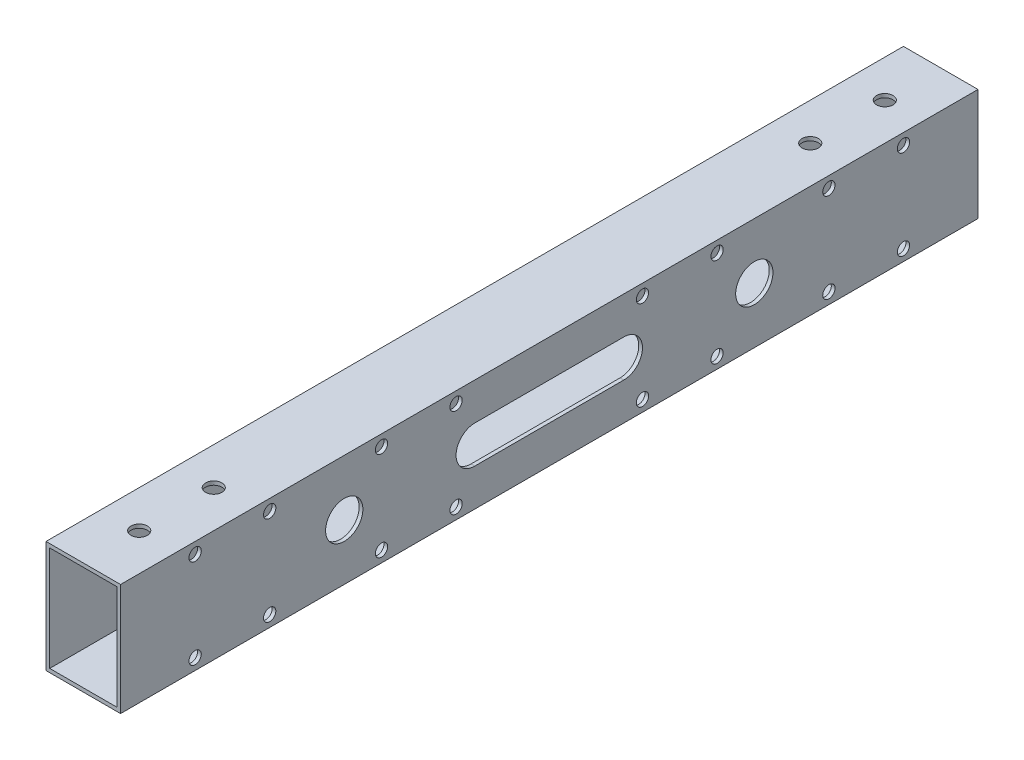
ISO-10303-21;
HEADER;
FILE_DESCRIPTION(('STEP AP214'),'2;1');
FILE_NAME('part.step','',(''),(''),'','','');
FILE_SCHEMA(('AUTOMOTIVE_DESIGN { 1 0 10303 214 1 1 1 1 }'));
ENDSEC;
DATA;
#1=APPLICATION_CONTEXT('core data for automotive mechanical design processes');
#2=APPLICATION_PROTOCOL_DEFINITION('international standard','automotive_design',2000,#1);
#3=PRODUCT_CONTEXT('',#1,'mechanical');
#4=PRODUCT('Part','Part','',(#3));
#5=PRODUCT_RELATED_PRODUCT_CATEGORY('part','',(#4));
#6=PRODUCT_DEFINITION_FORMATION('','',#4);
#7=PRODUCT_DEFINITION_CONTEXT('part definition',#1,'design');
#8=PRODUCT_DEFINITION('design','',#6,#7);
#9=PRODUCT_DEFINITION_SHAPE('','',#8);
#10=(LENGTH_UNIT() NAMED_UNIT(*) SI_UNIT(.MILLI.,.METRE.));
#11=(NAMED_UNIT(*) PLANE_ANGLE_UNIT() SI_UNIT($,.RADIAN.));
#12=(NAMED_UNIT(*) SI_UNIT($,.STERADIAN.) SOLID_ANGLE_UNIT());
#13=UNCERTAINTY_MEASURE_WITH_UNIT(LENGTH_MEASURE(1.E-05),#10,'distance_accuracy_value','');
#14=(GEOMETRIC_REPRESENTATION_CONTEXT(3) GLOBAL_UNCERTAINTY_ASSIGNED_CONTEXT((#13)) GLOBAL_UNIT_ASSIGNED_CONTEXT((#10,
#11,#12)) REPRESENTATION_CONTEXT('',''));
#15=CARTESIAN_POINT('',(0.,0.,0.));
#16=DIRECTION('',(0.,0.,1.));
#17=DIRECTION('',(1.,0.,0.));
#18=AXIS2_PLACEMENT_3D('',#15,#16,#17);
#19=CARTESIAN_POINT('',(-10.,-5.,135.));
#20=DIRECTION('',(0.,-1.,0.));
#21=DIRECTION('',(0.,0.,-1.));
#22=AXIS2_PLACEMENT_3D('',#19,#20,#21);
#23=PLANE('',#22);
#24=DIRECTION('',(0.,0.,1.));
#25=VECTOR('',#24,1.);
#26=CARTESIAN_POINT('',(9.,-5.,230.));
#27=LINE('',#26,#25);
#28=CARTESIAN_POINT('',(9.,-5.,95.));
#29=VERTEX_POINT('',#28);
#30=CARTESIAN_POINT('',(9.,-5.,135.));
#31=VERTEX_POINT('',#30);
#32=EDGE_CURVE('E243',#29,#31,#27,.T.);
#33=ORIENTED_EDGE('',*,*,#32,.T.);
#34=DIRECTION('',(1.,0.,0.));
#35=VECTOR('',#34,1.);
#36=CARTESIAN_POINT('',(-10.,-5.,135.));
#37=LINE('',#36,#35);
#38=CARTESIAN_POINT('',(10.,-5.,135.));
#39=VERTEX_POINT('',#38);
#40=EDGE_CURVE('E25',#31,#39,#37,.T.);
#41=ORIENTED_EDGE('',*,*,#40,.T.);
#42=DIRECTION('',(0.,0.,-1.));
#43=VECTOR('',#42,1.);
#44=CARTESIAN_POINT('',(10.,-5.,135.));
#45=LINE('',#44,#43);
#46=CARTESIAN_POINT('',(10.,-5.,95.));
#47=VERTEX_POINT('',#46);
#48=EDGE_CURVE('E210',#39,#47,#45,.T.);
#49=ORIENTED_EDGE('',*,*,#48,.T.);
#50=DIRECTION('',(1.,0.,0.));
#51=VECTOR('',#50,1.);
#52=CARTESIAN_POINT('',(-10.,-5.,95.));
#53=LINE('',#52,#51);
#54=EDGE_CURVE('E11',#29,#47,#53,.T.);
#55=ORIENTED_EDGE('',*,*,#54,.F.);
#56=EDGE_LOOP('',(#33,#41,#49,#55));
#57=FACE_BOUND('',#56,.T.);
#58=ADVANCED_FACE('F17',(#57),#23,.F.);
#59=CARTESIAN_POINT('',(-10.,5.,135.));
#60=DIRECTION('',(0.,1.,0.));
#61=DIRECTION('',(1.,0.,0.));
#62=AXIS2_PLACEMENT_3D('',#59,#60,#61);
#63=PLANE('',#62);
#64=DIRECTION('',(0.,0.,-1.));
#65=VECTOR('',#64,1.);
#66=CARTESIAN_POINT('',(9.,5.,230.));
#67=LINE('',#66,#65);
#68=CARTESIAN_POINT('',(9.,5.,135.));
#69=VERTEX_POINT('',#68);
#70=CARTESIAN_POINT('',(9.,5.,95.));
#71=VERTEX_POINT('',#70);
#72=EDGE_CURVE('E185',#69,#71,#67,.T.);
#73=ORIENTED_EDGE('',*,*,#72,.T.);
#74=DIRECTION('',(1.,0.,0.));
#75=VECTOR('',#74,1.);
#76=CARTESIAN_POINT('',(-10.,5.,95.));
#77=LINE('',#76,#75);
#78=CARTESIAN_POINT('',(10.,5.,95.));
#79=VERTEX_POINT('',#78);
#80=EDGE_CURVE('E287',#71,#79,#77,.T.);
#81=ORIENTED_EDGE('',*,*,#80,.T.);
#82=DIRECTION('',(0.,0.,1.));
#83=VECTOR('',#82,1.);
#84=CARTESIAN_POINT('',(10.,5.,135.));
#85=LINE('',#84,#83);
#86=CARTESIAN_POINT('',(10.,5.,135.));
#87=VERTEX_POINT('',#86);
#88=EDGE_CURVE('E219',#79,#87,#85,.T.);
#89=ORIENTED_EDGE('',*,*,#88,.T.);
#90=DIRECTION('',(1.,0.,0.));
#91=VECTOR('',#90,1.);
#92=CARTESIAN_POINT('',(-10.,5.,135.));
#93=LINE('',#92,#91);
#94=EDGE_CURVE('E263',#69,#87,#93,.T.);
#95=ORIENTED_EDGE('',*,*,#94,.F.);
#96=EDGE_LOOP('',(#73,#81,#89,#95));
#97=FACE_BOUND('',#96,.T.);
#98=ADVANCED_FACE('F748',(#97),#63,.F.);
#99=CARTESIAN_POINT('',(-10.,0.,135.));
#100=DIRECTION('',(1.,0.,0.));
#101=DIRECTION('',(0.,0.,-1.));
#102=AXIS2_PLACEMENT_3D('',#99,#100,#101);
#103=CYLINDRICAL_SURFACE('',#102,5.);
#104=CARTESIAN_POINT('',(9.,0.,135.));
#105=DIRECTION('',(-1.,0.,0.));
#106=DIRECTION('',(0.,0.,1.));
#107=AXIS2_PLACEMENT_3D('',#104,#105,#106);
#108=CIRCLE('',#107,5.);
#109=EDGE_CURVE('E296',#31,#69,#108,.T.);
#110=ORIENTED_EDGE('',*,*,#109,.T.);
#111=ORIENTED_EDGE('',*,*,#94,.T.);
#112=CARTESIAN_POINT('',(10.,0.,135.));
#113=DIRECTION('',(1.,0.,0.));
#114=DIRECTION('',(0.,0.,-1.));
#115=AXIS2_PLACEMENT_3D('',#112,#113,#114);
#116=CIRCLE('',#115,5.);
#117=EDGE_CURVE('E214',#87,#39,#116,.T.);
#118=ORIENTED_EDGE('',*,*,#117,.T.);
#119=ORIENTED_EDGE('',*,*,#40,.F.);
#120=EDGE_LOOP('',(#110,#111,#118,#119));
#121=FACE_BOUND('',#120,.T.);
#122=ADVANCED_FACE('F277',(#121),#103,.F.);
#123=CARTESIAN_POINT('',(-10.,0.,135.));
#124=DIRECTION('',(1.,0.,0.));
#125=DIRECTION('',(0.,0.,-1.));
#126=AXIS2_PLACEMENT_3D('',#123,#124,#125);
#127=CYLINDRICAL_SURFACE('',#126,5.);
#128=CARTESIAN_POINT('',(-9.,0.,135.));
#129=DIRECTION('',(1.,0.,0.));
#130=DIRECTION('',(0.,0.,-1.));
#131=AXIS2_PLACEMENT_3D('',#128,#129,#130);
#132=CIRCLE('',#131,5.);
#133=CARTESIAN_POINT('',(-9.,5.,135.));
#134=VERTEX_POINT('',#133);
#135=CARTESIAN_POINT('',(-9.,-5.,135.));
#136=VERTEX_POINT('',#135);
#137=EDGE_CURVE('E247',#134,#136,#132,.T.);
#138=ORIENTED_EDGE('',*,*,#137,.T.);
#139=DIRECTION('',(1.,0.,0.));
#140=VECTOR('',#139,1.);
#141=CARTESIAN_POINT('',(-10.,-5.,135.));
#142=LINE('',#141,#140);
#143=CARTESIAN_POINT('',(-10.,-5.,135.));
#144=VERTEX_POINT('',#143);
#145=EDGE_CURVE('E49',#144,#136,#142,.T.);
#146=ORIENTED_EDGE('',*,*,#145,.F.);
#147=CARTESIAN_POINT('',(-10.,0.,135.));
#148=DIRECTION('',(1.,0.,0.));
#149=DIRECTION('',(0.,0.,-1.));
#150=AXIS2_PLACEMENT_3D('',#147,#148,#149);
#151=CIRCLE('',#150,5.);
#152=CARTESIAN_POINT('',(-10.,5.,135.));
#153=VERTEX_POINT('',#152);
#154=EDGE_CURVE('E230',#153,#144,#151,.T.);
#155=ORIENTED_EDGE('',*,*,#154,.F.);
#156=DIRECTION('',(1.,0.,0.));
#157=VECTOR('',#156,1.);
#158=CARTESIAN_POINT('',(-10.,5.,135.));
#159=LINE('',#158,#157);
#160=EDGE_CURVE('E260',#153,#134,#159,.T.);
#161=ORIENTED_EDGE('',*,*,#160,.T.);
#162=EDGE_LOOP('',(#138,#146,#155,#161));
#163=FACE_BOUND('',#162,.T.);
#164=ADVANCED_FACE('F756',(#163),#127,.F.);
#165=CARTESIAN_POINT('',(-10.,5.,135.));
#166=DIRECTION('',(0.,1.,0.));
#167=DIRECTION('',(1.,0.,0.));
#168=AXIS2_PLACEMENT_3D('',#165,#166,#167);
#169=PLANE('',#168);
#170=DIRECTION('',(0.,0.,1.));
#171=VECTOR('',#170,1.);
#172=CARTESIAN_POINT('',(-9.,5.,230.));
#173=LINE('',#172,#171);
#174=CARTESIAN_POINT('',(-9.,5.,95.));
#175=VERTEX_POINT('',#174);
#176=EDGE_CURVE('E251',#175,#134,#173,.T.);
#177=ORIENTED_EDGE('',*,*,#176,.T.);
#178=ORIENTED_EDGE('',*,*,#160,.F.);
#179=DIRECTION('',(0.,0.,1.));
#180=VECTOR('',#179,1.);
#181=CARTESIAN_POINT('',(-10.,5.,135.));
#182=LINE('',#181,#180);
#183=CARTESIAN_POINT('',(-10.,5.,95.));
#184=VERTEX_POINT('',#183);
#185=EDGE_CURVE('E229',#184,#153,#182,.T.);
#186=ORIENTED_EDGE('',*,*,#185,.F.);
#187=DIRECTION('',(1.,0.,0.));
#188=VECTOR('',#187,1.);
#189=CARTESIAN_POINT('',(-10.,5.,95.));
#190=LINE('',#189,#188);
#191=EDGE_CURVE('E608',#184,#175,#190,.T.);
#192=ORIENTED_EDGE('',*,*,#191,.T.);
#193=EDGE_LOOP('',(#177,#178,#186,#192));
#194=FACE_BOUND('',#193,.T.);
#195=ADVANCED_FACE('F761',(#194),#169,.F.);
#196=CARTESIAN_POINT('',(-10.,-5.,135.));
#197=DIRECTION('',(0.,-1.,0.));
#198=DIRECTION('',(0.,0.,-1.));
#199=AXIS2_PLACEMENT_3D('',#196,#197,#198);
#200=PLANE('',#199);
#201=DIRECTION('',(0.,0.,-1.));
#202=VECTOR('',#201,1.);
#203=CARTESIAN_POINT('',(-9.,-5.,230.));
#204=LINE('',#203,#202);
#205=CARTESIAN_POINT('',(-9.,-5.,95.));
#206=VERTEX_POINT('',#205);
#207=EDGE_CURVE('E252',#136,#206,#204,.T.);
#208=ORIENTED_EDGE('',*,*,#207,.T.);
#209=DIRECTION('',(1.,0.,0.));
#210=VECTOR('',#209,1.);
#211=CARTESIAN_POINT('',(-10.,-5.,95.));
#212=LINE('',#211,#210);
#213=CARTESIAN_POINT('',(-10.,-5.,95.));
#214=VERTEX_POINT('',#213);
#215=EDGE_CURVE('E255',#214,#206,#212,.T.);
#216=ORIENTED_EDGE('',*,*,#215,.F.);
#217=DIRECTION('',(0.,0.,-1.));
#218=VECTOR('',#217,1.);
#219=CARTESIAN_POINT('',(-10.,-5.,135.));
#220=LINE('',#219,#218);
#221=EDGE_CURVE('E234',#144,#214,#220,.T.);
#222=ORIENTED_EDGE('',*,*,#221,.F.);
#223=ORIENTED_EDGE('',*,*,#145,.T.);
#224=EDGE_LOOP('',(#208,#216,#222,#223));
#225=FACE_BOUND('',#224,.T.);
#226=ADVANCED_FACE('F788',(#225),#200,.F.);
#227=CARTESIAN_POINT('',(-9.,-14.,230.));
#228=DIRECTION('',(0.,1.,0.));
#229=DIRECTION('',(1.,0.,0.));
#230=AXIS2_PLACEMENT_3D('',#227,#228,#229);
#231=PLANE('',#230);
#232=CARTESIAN_POINT('',(0.,-14.,215.));
#233=DIRECTION('',(0.,1.,0.));
#234=DIRECTION('',(0.,0.,1.));
#235=AXIS2_PLACEMENT_3D('',#232,#233,#234);
#236=CIRCLE('',#235,2.2);
#237=CARTESIAN_POINT('',(0.,-14.,217.2));
#238=VERTEX_POINT('',#237);
#239=EDGE_CURVE('E663',#238,#238,#236,.T.);
#240=ORIENTED_EDGE('',*,*,#239,.F.);
#241=EDGE_LOOP('',(#240));
#242=FACE_BOUND('',#241,.T.);
#243=CARTESIAN_POINT('',(0.,-14.,195.));
#244=DIRECTION('',(0.,1.,0.));
#245=DIRECTION('',(0.,0.,1.));
#246=AXIS2_PLACEMENT_3D('',#243,#244,#245);
#247=CIRCLE('',#246,2.2);
#248=CARTESIAN_POINT('',(0.,-14.,197.2));
#249=VERTEX_POINT('',#248);
#250=EDGE_CURVE('E655',#249,#249,#247,.T.);
#251=ORIENTED_EDGE('',*,*,#250,.F.);
#252=EDGE_LOOP('',(#251));
#253=FACE_BOUND('',#252,.T.);
#254=CARTESIAN_POINT('',(6.66827704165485E-12,-14.,35.0000000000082));
#255=DIRECTION('',(0.,1.,0.));
#256=DIRECTION('',(0.,0.,1.));
#257=AXIS2_PLACEMENT_3D('',#254,#255,#256);
#258=CIRCLE('',#257,2.2);
#259=CARTESIAN_POINT('',(6.66827704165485E-12,-14.,37.2000000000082));
#260=VERTEX_POINT('',#259);
#261=EDGE_CURVE('E647',#260,#260,#258,.T.);
#262=ORIENTED_EDGE('',*,*,#261,.F.);
#263=EDGE_LOOP('',(#262));
#264=FACE_BOUND('',#263,.T.);
#265=CARTESIAN_POINT('',(6.66827704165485E-12,-14.,15.0000000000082));
#266=DIRECTION('',(0.,1.,0.));
#267=DIRECTION('',(0.,0.,1.));
#268=AXIS2_PLACEMENT_3D('',#265,#266,#267);
#269=CIRCLE('',#268,2.2);
#270=CARTESIAN_POINT('',(6.66827704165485E-12,-14.,17.2000000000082));
#271=VERTEX_POINT('',#270);
#272=EDGE_CURVE('E463',#271,#271,#269,.T.);
#273=ORIENTED_EDGE('',*,*,#272,.F.);
#274=EDGE_LOOP('',(#273));
#275=FACE_BOUND('',#274,.T.);
#276=DIRECTION('',(1.,0.,0.));
#277=VECTOR('',#276,1.);
#278=CARTESIAN_POINT('',(-9.,-14.,0.));
#279=LINE('',#278,#277);
#280=CARTESIAN_POINT('',(-9.,-14.,0.));
#281=VERTEX_POINT('',#280);
#282=CARTESIAN_POINT('',(9.,-14.,0.));
#283=VERTEX_POINT('',#282);
#284=EDGE_CURVE('E206',#281,#283,#279,.T.);
#285=ORIENTED_EDGE('',*,*,#284,.F.);
#286=DIRECTION('',(0.,0.,-1.));
#287=VECTOR('',#286,1.);
#288=CARTESIAN_POINT('',(-9.,-14.,230.));
#289=LINE('',#288,#287);
#290=CARTESIAN_POINT('',(-9.,-14.,230.));
#291=VERTEX_POINT('',#290);
#292=EDGE_CURVE('E184',#291,#281,#289,.T.);
#293=ORIENTED_EDGE('',*,*,#292,.F.);
#294=DIRECTION('',(1.,0.,0.));
#295=VECTOR('',#294,1.);
#296=CARTESIAN_POINT('',(-9.,-14.,230.));
#297=LINE('',#296,#295);
#298=CARTESIAN_POINT('',(9.,-14.,230.));
#299=VERTEX_POINT('',#298);
#300=EDGE_CURVE('E414',#291,#299,#297,.T.);
#301=ORIENTED_EDGE('',*,*,#300,.T.);
#302=DIRECTION('',(0.,0.,-1.));
#303=VECTOR('',#302,1.);
#304=CARTESIAN_POINT('',(9.,-14.,230.));
#305=LINE('',#304,#303);
#306=EDGE_CURVE('E238',#299,#283,#305,.T.);
#307=ORIENTED_EDGE('',*,*,#306,.T.);
#308=EDGE_LOOP('',(#285,#293,#301,#307));
#309=FACE_BOUND('',#308,.T.);
#310=ADVANCED_FACE('F712',(#242,#253,#264,#275,#309),#231,.T.);
#311=CARTESIAN_POINT('',(-9.,-14.,230.));
#312=DIRECTION('',(1.,0.,0.));
#313=DIRECTION('',(0.,1.,0.));
#314=AXIS2_PLACEMENT_3D('',#311,#312,#313);
#315=PLANE('',#314);
#316=ORIENTED_EDGE('',*,*,#137,.F.);
#317=ORIENTED_EDGE('',*,*,#176,.F.);
#318=CARTESIAN_POINT('',(-9.,0.,95.));
#319=DIRECTION('',(1.,0.,0.));
#320=DIRECTION('',(0.,0.,-1.));
#321=AXIS2_PLACEMENT_3D('',#318,#319,#320);
#322=CIRCLE('',#321,5.);
#323=EDGE_CURVE('E38',#206,#175,#322,.T.);
#324=ORIENTED_EDGE('',*,*,#323,.F.);
#325=ORIENTED_EDGE('',*,*,#207,.F.);
#326=EDGE_LOOP('',(#316,#317,#324,#325));
#327=FACE_BOUND('',#326,.T.);
#328=CARTESIAN_POINT('',(-9.,0.,170.));
#329=DIRECTION('',(1.,0.,0.));
#330=DIRECTION('',(0.,0.,-1.));
#331=AXIS2_PLACEMENT_3D('',#328,#329,#330);
#332=CIRCLE('',#331,5.);
#333=CARTESIAN_POINT('',(-9.,0.,165.));
#334=VERTEX_POINT('',#333);
#335=EDGE_CURVE('E598',#334,#334,#332,.T.);
#336=ORIENTED_EDGE('',*,*,#335,.F.);
#337=EDGE_LOOP('',(#336));
#338=FACE_BOUND('',#337,.T.);
#339=CARTESIAN_POINT('',(-9.,0.,60.));
#340=DIRECTION('',(1.,0.,0.));
#341=DIRECTION('',(0.,0.,-1.));
#342=AXIS2_PLACEMENT_3D('',#339,#340,#341);
#343=CIRCLE('',#342,5.);
#344=CARTESIAN_POINT('',(-9.,0.,55.));
#345=VERTEX_POINT('',#344);
#346=EDGE_CURVE('E443',#345,#345,#343,.T.);
#347=ORIENTED_EDGE('',*,*,#346,.F.);
#348=EDGE_LOOP('',(#347));
#349=FACE_BOUND('',#348,.T.);
#350=CARTESIAN_POINT('',(-9.,-12.,210.));
#351=DIRECTION('',(1.,0.,0.));
#352=DIRECTION('',(0.,0.,-1.));
#353=AXIS2_PLACEMENT_3D('',#350,#351,#352);
#354=CIRCLE('',#353,1.65);
#355=CARTESIAN_POINT('',(-9.,-12.,208.35));
#356=VERTEX_POINT('',#355);
#357=EDGE_CURVE('E358',#356,#356,#354,.T.);
#358=ORIENTED_EDGE('',*,*,#357,.F.);
#359=EDGE_LOOP('',(#358));
#360=FACE_BOUND('',#359,.T.);
#361=CARTESIAN_POINT('',(-9.,12.,210.));
#362=DIRECTION('',(1.,0.,0.));
#363=DIRECTION('',(0.,0.,-1.));
#364=AXIS2_PLACEMENT_3D('',#361,#362,#363);
#365=CIRCLE('',#364,1.65);
#366=CARTESIAN_POINT('',(-9.,12.,208.35));
#367=VERTEX_POINT('',#366);
#368=EDGE_CURVE('E341',#367,#367,#365,.T.);
#369=ORIENTED_EDGE('',*,*,#368,.F.);
#370=EDGE_LOOP('',(#369));
#371=FACE_BOUND('',#370,.T.);
#372=CARTESIAN_POINT('',(-9.,12.,190.));
#373=DIRECTION('',(1.,0.,0.));
#374=DIRECTION('',(0.,0.,-1.));
#375=AXIS2_PLACEMENT_3D('',#372,#373,#374);
#376=CIRCLE('',#375,1.65);
#377=CARTESIAN_POINT('',(-9.,12.,188.35));
#378=VERTEX_POINT('',#377);
#379=EDGE_CURVE('E396',#378,#378,#376,.T.);
#380=ORIENTED_EDGE('',*,*,#379,.F.);
#381=EDGE_LOOP('',(#380));
#382=FACE_BOUND('',#381,.T.);
#383=CARTESIAN_POINT('',(-9.,12.,160.));
#384=DIRECTION('',(1.,0.,0.));
#385=DIRECTION('',(0.,0.,-1.));
#386=AXIS2_PLACEMENT_3D('',#383,#384,#385);
#387=CIRCLE('',#386,1.65000000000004);
#388=CARTESIAN_POINT('',(-9.,12.,158.35));
#389=VERTEX_POINT('',#388);
#390=EDGE_CURVE('E528',#389,#389,#387,.T.);
#391=ORIENTED_EDGE('',*,*,#390,.F.);
#392=EDGE_LOOP('',(#391));
#393=FACE_BOUND('',#392,.T.);
#394=CARTESIAN_POINT('',(-9.,12.,140.));
#395=DIRECTION('',(1.,0.,0.));
#396=DIRECTION('',(0.,0.,-1.));
#397=AXIS2_PLACEMENT_3D('',#394,#395,#396);
#398=CIRCLE('',#397,1.65);
#399=CARTESIAN_POINT('',(-9.,12.,138.35));
#400=VERTEX_POINT('',#399);
#401=EDGE_CURVE('E323',#400,#400,#398,.T.);
#402=ORIENTED_EDGE('',*,*,#401,.F.);
#403=EDGE_LOOP('',(#402));
#404=FACE_BOUND('',#403,.T.);
#405=CARTESIAN_POINT('',(-9.,12.,90.));
#406=DIRECTION('',(1.,0.,0.));
#407=DIRECTION('',(0.,0.,-1.));
#408=AXIS2_PLACEMENT_3D('',#405,#406,#407);
#409=CIRCLE('',#408,1.65);
#410=CARTESIAN_POINT('',(-9.,12.,88.35));
#411=VERTEX_POINT('',#410);
#412=EDGE_CURVE('E523',#411,#411,#409,.T.);
#413=ORIENTED_EDGE('',*,*,#412,.F.);
#414=EDGE_LOOP('',(#413));
#415=FACE_BOUND('',#414,.T.);
#416=CARTESIAN_POINT('',(-9.,12.,70.));
#417=DIRECTION('',(1.,0.,0.));
#418=DIRECTION('',(0.,0.,-1.));
#419=AXIS2_PLACEMENT_3D('',#416,#417,#418);
#420=CIRCLE('',#419,1.65000000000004);
#421=CARTESIAN_POINT('',(-9.,12.,68.35));
#422=VERTEX_POINT('',#421);
#423=EDGE_CURVE('E524',#422,#422,#420,.T.);
#424=ORIENTED_EDGE('',*,*,#423,.F.);
#425=EDGE_LOOP('',(#424));
#426=FACE_BOUND('',#425,.T.);
#427=CARTESIAN_POINT('',(-9.,12.,40.));
#428=DIRECTION('',(1.,0.,0.));
#429=DIRECTION('',(0.,0.,-1.));
#430=AXIS2_PLACEMENT_3D('',#427,#428,#429);
#431=CIRCLE('',#430,1.65);
#432=CARTESIAN_POINT('',(-9.,12.,38.35));
#433=VERTEX_POINT('',#432);
#434=EDGE_CURVE('E552',#433,#433,#431,.T.);
#435=ORIENTED_EDGE('',*,*,#434,.F.);
#436=EDGE_LOOP('',(#435));
#437=FACE_BOUND('',#436,.T.);
#438=CARTESIAN_POINT('',(-9.,12.,20.));
#439=DIRECTION('',(1.,0.,0.));
#440=DIRECTION('',(0.,0.,-1.));
#441=AXIS2_PLACEMENT_3D('',#438,#439,#440);
#442=CIRCLE('',#441,1.65);
#443=CARTESIAN_POINT('',(-9.,12.,18.35));
#444=VERTEX_POINT('',#443);
#445=EDGE_CURVE('E547',#444,#444,#442,.T.);
#446=ORIENTED_EDGE('',*,*,#445,.F.);
#447=EDGE_LOOP('',(#446));
#448=FACE_BOUND('',#447,.T.);
#449=CARTESIAN_POINT('',(-9.,-12.,20.));
#450=DIRECTION('',(1.,0.,0.));
#451=DIRECTION('',(0.,0.,-1.));
#452=AXIS2_PLACEMENT_3D('',#449,#450,#451);
#453=CIRCLE('',#452,1.65);
#454=CARTESIAN_POINT('',(-9.,-12.,18.35));
#455=VERTEX_POINT('',#454);
#456=EDGE_CURVE('E539',#455,#455,#453,.T.);
#457=ORIENTED_EDGE('',*,*,#456,.F.);
#458=EDGE_LOOP('',(#457));
#459=FACE_BOUND('',#458,.T.);
#460=CARTESIAN_POINT('',(-9.,-12.,40.));
#461=DIRECTION('',(1.,0.,0.));
#462=DIRECTION('',(0.,0.,-1.));
#463=AXIS2_PLACEMENT_3D('',#460,#461,#462);
#464=CIRCLE('',#463,1.65);
#465=CARTESIAN_POINT('',(-9.,-12.,38.35));
#466=VERTEX_POINT('',#465);
#467=EDGE_CURVE('E329',#466,#466,#464,.T.);
#468=ORIENTED_EDGE('',*,*,#467,.F.);
#469=EDGE_LOOP('',(#468));
#470=FACE_BOUND('',#469,.T.);
#471=CARTESIAN_POINT('',(-9.,-12.,70.));
#472=DIRECTION('',(1.,0.,0.));
#473=DIRECTION('',(0.,0.,-1.));
#474=AXIS2_PLACEMENT_3D('',#471,#472,#473);
#475=CIRCLE('',#474,1.65000000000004);
#476=CARTESIAN_POINT('',(-9.,-12.,68.35));
#477=VERTEX_POINT('',#476);
#478=EDGE_CURVE('E485',#477,#477,#475,.T.);
#479=ORIENTED_EDGE('',*,*,#478,.F.);
#480=EDGE_LOOP('',(#479));
#481=FACE_BOUND('',#480,.T.);
#482=CARTESIAN_POINT('',(-9.,-12.,90.));
#483=DIRECTION('',(1.,0.,0.));
#484=DIRECTION('',(0.,0.,-1.));
#485=AXIS2_PLACEMENT_3D('',#482,#483,#484);
#486=CIRCLE('',#485,1.65);
#487=CARTESIAN_POINT('',(-9.,-12.,88.35));
#488=VERTEX_POINT('',#487);
#489=EDGE_CURVE('E511',#488,#488,#486,.T.);
#490=ORIENTED_EDGE('',*,*,#489,.F.);
#491=EDGE_LOOP('',(#490));
#492=FACE_BOUND('',#491,.T.);
#493=CARTESIAN_POINT('',(-9.,-12.,140.));
#494=DIRECTION('',(1.,0.,0.));
#495=DIRECTION('',(0.,0.,-1.));
#496=AXIS2_PLACEMENT_3D('',#493,#494,#495);
#497=CIRCLE('',#496,1.65);
#498=CARTESIAN_POINT('',(-9.,-12.,138.35));
#499=VERTEX_POINT('',#498);
#500=EDGE_CURVE('E512',#499,#499,#497,.T.);
#501=ORIENTED_EDGE('',*,*,#500,.F.);
#502=EDGE_LOOP('',(#501));
#503=FACE_BOUND('',#502,.T.);
#504=CARTESIAN_POINT('',(-9.,-12.,160.));
#505=DIRECTION('',(1.,0.,0.));
#506=DIRECTION('',(0.,0.,-1.));
#507=AXIS2_PLACEMENT_3D('',#504,#505,#506);
#508=CIRCLE('',#507,1.65000000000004);
#509=CARTESIAN_POINT('',(-9.,-12.,158.35));
#510=VERTEX_POINT('',#509);
#511=EDGE_CURVE('E467',#510,#510,#508,.T.);
#512=ORIENTED_EDGE('',*,*,#511,.F.);
#513=EDGE_LOOP('',(#512));
#514=FACE_BOUND('',#513,.T.);
#515=CARTESIAN_POINT('',(-9.,-12.,190.));
#516=DIRECTION('',(1.,0.,0.));
#517=DIRECTION('',(0.,0.,-1.));
#518=AXIS2_PLACEMENT_3D('',#515,#516,#517);
#519=CIRCLE('',#518,1.65);
#520=CARTESIAN_POINT('',(-9.,-12.,188.35));
#521=VERTEX_POINT('',#520);
#522=EDGE_CURVE('E500',#521,#521,#519,.T.);
#523=ORIENTED_EDGE('',*,*,#522,.F.);
#524=EDGE_LOOP('',(#523));
#525=FACE_BOUND('',#524,.T.);
#526=DIRECTION('',(0.,-1.,0.));
#527=VECTOR('',#526,1.);
#528=CARTESIAN_POINT('',(-9.,-14.,0.));
#529=LINE('',#528,#527);
#530=CARTESIAN_POINT('',(-9.,14.,0.));
#531=VERTEX_POINT('',#530);
#532=EDGE_CURVE('E188',#531,#281,#529,.T.);
#533=ORIENTED_EDGE('',*,*,#532,.F.);
#534=DIRECTION('',(0.,0.,-1.));
#535=VECTOR('',#534,1.);
#536=CARTESIAN_POINT('',(-9.,14.,230.));
#537=LINE('',#536,#535);
#538=CARTESIAN_POINT('',(-9.,14.,230.));
#539=VERTEX_POINT('',#538);
#540=EDGE_CURVE('E172',#539,#531,#537,.T.);
#541=ORIENTED_EDGE('',*,*,#540,.F.);
#542=DIRECTION('',(0.,-1.,0.));
#543=VECTOR('',#542,1.);
#544=CARTESIAN_POINT('',(-9.,-14.,230.));
#545=LINE('',#544,#543);
#546=EDGE_CURVE('E411',#539,#291,#545,.T.);
#547=ORIENTED_EDGE('',*,*,#546,.T.);
#548=ORIENTED_EDGE('',*,*,#292,.T.);
#549=EDGE_LOOP('',(#533,#541,#547,#548));
#550=FACE_BOUND('',#549,.T.);
#551=ADVANCED_FACE('F189',(#327,#338,#349,#360,#371,#382,#393,#404,#415,#426,#437,#448,#459,
#470,#481,#492,#503,#514,#525,#550),#315,.T.);
#552=CARTESIAN_POINT('',(-9.,14.,230.));
#553=DIRECTION('',(0.,-1.,0.));
#554=DIRECTION('',(0.,0.,-1.));
#555=AXIS2_PLACEMENT_3D('',#552,#553,#554);
#556=PLANE('',#555);
#557=CARTESIAN_POINT('',(0.,14.,215.));
#558=DIRECTION('',(0.,-1.,0.));
#559=DIRECTION('',(0.,0.,-1.));
#560=AXIS2_PLACEMENT_3D('',#557,#558,#559);
#561=CIRCLE('',#560,2.2);
#562=CARTESIAN_POINT('',(0.,14.,212.8));
#563=VERTEX_POINT('',#562);
#564=EDGE_CURVE('E335',#563,#563,#561,.T.);
#565=ORIENTED_EDGE('',*,*,#564,.F.);
#566=EDGE_LOOP('',(#565));
#567=FACE_BOUND('',#566,.T.);
#568=CARTESIAN_POINT('',(0.,14.,195.));
#569=DIRECTION('',(0.,-1.,0.));
#570=DIRECTION('',(0.,0.,-1.));
#571=AXIS2_PLACEMENT_3D('',#568,#569,#570);
#572=CIRCLE('',#571,2.2);
#573=CARTESIAN_POINT('',(0.,14.,192.8));
#574=VERTEX_POINT('',#573);
#575=EDGE_CURVE('E628',#574,#574,#572,.T.);
#576=ORIENTED_EDGE('',*,*,#575,.F.);
#577=EDGE_LOOP('',(#576));
#578=FACE_BOUND('',#577,.T.);
#579=CARTESIAN_POINT('',(6.66827704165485E-12,14.,35.0000000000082));
#580=DIRECTION('',(0.,-1.,0.));
#581=DIRECTION('',(0.,0.,-1.));
#582=AXIS2_PLACEMENT_3D('',#579,#580,#581);
#583=CIRCLE('',#582,2.2);
#584=CARTESIAN_POINT('',(6.66827704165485E-12,14.,32.8000000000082));
#585=VERTEX_POINT('',#584);
#586=EDGE_CURVE('E620',#585,#585,#583,.T.);
#587=ORIENTED_EDGE('',*,*,#586,.F.);
#588=EDGE_LOOP('',(#587));
#589=FACE_BOUND('',#588,.T.);
#590=CARTESIAN_POINT('',(6.66827704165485E-12,14.,15.0000000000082));
#591=DIRECTION('',(0.,-1.,0.));
#592=DIRECTION('',(0.,0.,-1.));
#593=AXIS2_PLACEMENT_3D('',#590,#591,#592);
#594=CIRCLE('',#593,2.2);
#595=CARTESIAN_POINT('',(6.66827704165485E-12,14.,12.8000000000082));
#596=VERTEX_POINT('',#595);
#597=EDGE_CURVE('E612',#596,#596,#594,.T.);
#598=ORIENTED_EDGE('',*,*,#597,.F.);
#599=EDGE_LOOP('',(#598));
#600=FACE_BOUND('',#599,.T.);
#601=DIRECTION('',(-1.,0.,0.));
#602=VECTOR('',#601,1.);
#603=CARTESIAN_POINT('',(-9.,14.,0.));
#604=LINE('',#603,#602);
#605=CARTESIAN_POINT('',(9.,14.,0.));
#606=VERTEX_POINT('',#605);
#607=EDGE_CURVE('E176',#606,#531,#604,.T.);
#608=ORIENTED_EDGE('',*,*,#607,.F.);
#609=DIRECTION('',(0.,0.,-1.));
#610=VECTOR('',#609,1.);
#611=CARTESIAN_POINT('',(9.,14.,230.));
#612=LINE('',#611,#610);
#613=CARTESIAN_POINT('',(9.,14.,230.));
#614=VERTEX_POINT('',#613);
#615=EDGE_CURVE('E241',#614,#606,#612,.T.);
#616=ORIENTED_EDGE('',*,*,#615,.F.);
#617=DIRECTION('',(-1.,0.,0.));
#618=VECTOR('',#617,1.);
#619=CARTESIAN_POINT('',(-9.,14.,230.));
#620=LINE('',#619,#618);
#621=EDGE_CURVE('E179',#614,#539,#620,.T.);
#622=ORIENTED_EDGE('',*,*,#621,.T.);
#623=ORIENTED_EDGE('',*,*,#540,.T.);
#624=EDGE_LOOP('',(#608,#616,#622,#623));
#625=FACE_BOUND('',#624,.T.);
#626=ADVANCED_FACE('F174',(#567,#578,#589,#600,#625),#556,.T.);
#627=CARTESIAN_POINT('',(9.,-14.,230.));
#628=DIRECTION('',(-1.,0.,0.));
#629=DIRECTION('',(0.,0.,1.));
#630=AXIS2_PLACEMENT_3D('',#627,#628,#629);
#631=PLANE('',#630);
#632=ORIENTED_EDGE('',*,*,#109,.F.);
#633=ORIENTED_EDGE('',*,*,#32,.F.);
#634=CARTESIAN_POINT('',(9.,0.,95.));
#635=DIRECTION('',(-1.,0.,0.));
#636=DIRECTION('',(0.,0.,1.));
#637=AXIS2_PLACEMENT_3D('',#634,#635,#636);
#638=CIRCLE('',#637,5.);
#639=EDGE_CURVE('E288',#71,#29,#638,.T.);
#640=ORIENTED_EDGE('',*,*,#639,.F.);
#641=ORIENTED_EDGE('',*,*,#72,.F.);
#642=EDGE_LOOP('',(#632,#633,#640,#641));
#643=FACE_BOUND('',#642,.T.);
#644=CARTESIAN_POINT('',(9.,0.,170.));
#645=DIRECTION('',(-1.,0.,0.));
#646=DIRECTION('',(0.,0.,1.));
#647=AXIS2_PLACEMENT_3D('',#644,#645,#646);
#648=CIRCLE('',#647,5.);
#649=CARTESIAN_POINT('',(9.,0.,175.));
#650=VERTEX_POINT('',#649);
#651=EDGE_CURVE('E578',#650,#650,#648,.T.);
#652=ORIENTED_EDGE('',*,*,#651,.F.);
#653=EDGE_LOOP('',(#652));
#654=FACE_BOUND('',#653,.T.);
#655=CARTESIAN_POINT('',(9.,0.,60.));
#656=DIRECTION('',(-1.,0.,0.));
#657=DIRECTION('',(0.,0.,1.));
#658=AXIS2_PLACEMENT_3D('',#655,#656,#657);
#659=CIRCLE('',#658,5.);
#660=CARTESIAN_POINT('',(9.,0.,65.));
#661=VERTEX_POINT('',#660);
#662=EDGE_CURVE('E353',#661,#661,#659,.T.);
#663=ORIENTED_EDGE('',*,*,#662,.F.);
#664=EDGE_LOOP('',(#663));
#665=FACE_BOUND('',#664,.T.);
#666=CARTESIAN_POINT('',(9.,-12.,210.));
#667=DIRECTION('',(-1.,0.,0.));
#668=DIRECTION('',(0.,0.,1.));
#669=AXIS2_PLACEMENT_3D('',#666,#667,#668);
#670=CIRCLE('',#669,1.65);
#671=CARTESIAN_POINT('',(9.,-12.,211.65));
#672=VERTEX_POINT('',#671);
#673=EDGE_CURVE('E401',#672,#672,#670,.T.);
#674=ORIENTED_EDGE('',*,*,#673,.F.);
#675=EDGE_LOOP('',(#674));
#676=FACE_BOUND('',#675,.T.);
#677=CARTESIAN_POINT('',(9.,12.,210.));
#678=DIRECTION('',(-1.,0.,0.));
#679=DIRECTION('',(0.,0.,1.));
#680=AXIS2_PLACEMENT_3D('',#677,#678,#679);
#681=CIRCLE('',#680,1.65);
#682=CARTESIAN_POINT('',(9.,12.,211.65));
#683=VERTEX_POINT('',#682);
#684=EDGE_CURVE('E402',#683,#683,#681,.T.);
#685=ORIENTED_EDGE('',*,*,#684,.F.);
#686=EDGE_LOOP('',(#685));
#687=FACE_BOUND('',#686,.T.);
#688=CARTESIAN_POINT('',(9.,12.,190.));
#689=DIRECTION('',(-1.,0.,0.));
#690=DIRECTION('',(0.,0.,1.));
#691=AXIS2_PLACEMENT_3D('',#688,#689,#690);
#692=CIRCLE('',#691,1.65);
#693=CARTESIAN_POINT('',(9.,12.,191.65));
#694=VERTEX_POINT('',#693);
#695=EDGE_CURVE('E410',#694,#694,#692,.T.);
#696=ORIENTED_EDGE('',*,*,#695,.F.);
#697=EDGE_LOOP('',(#696));
#698=FACE_BOUND('',#697,.T.);
#699=CARTESIAN_POINT('',(9.,12.,160.));
#700=DIRECTION('',(-1.,0.,0.));
#701=DIRECTION('',(0.,0.,1.));
#702=AXIS2_PLACEMENT_3D('',#699,#700,#701);
#703=CIRCLE('',#702,1.65000000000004);
#704=CARTESIAN_POINT('',(9.,12.,161.65));
#705=VERTEX_POINT('',#704);
#706=EDGE_CURVE('E442',#705,#705,#703,.T.);
#707=ORIENTED_EDGE('',*,*,#706,.F.);
#708=EDGE_LOOP('',(#707));
#709=FACE_BOUND('',#708,.T.);
#710=CARTESIAN_POINT('',(9.,12.,140.));
#711=DIRECTION('',(-1.,0.,0.));
#712=DIRECTION('',(0.,0.,1.));
#713=AXIS2_PLACEMENT_3D('',#710,#711,#712);
#714=CIRCLE('',#713,1.65);
#715=CARTESIAN_POINT('',(9.,12.,141.65));
#716=VERTEX_POINT('',#715);
#717=EDGE_CURVE('E321',#716,#716,#714,.T.);
#718=ORIENTED_EDGE('',*,*,#717,.F.);
#719=EDGE_LOOP('',(#718));
#720=FACE_BOUND('',#719,.T.);
#721=CARTESIAN_POINT('',(9.,12.,90.));
#722=DIRECTION('',(-1.,0.,0.));
#723=DIRECTION('',(0.,0.,1.));
#724=AXIS2_PLACEMENT_3D('',#721,#722,#723);
#725=CIRCLE('',#724,1.65);
#726=CARTESIAN_POINT('',(9.,12.,91.65));
#727=VERTEX_POINT('',#726);
#728=EDGE_CURVE('E322',#727,#727,#725,.T.);
#729=ORIENTED_EDGE('',*,*,#728,.F.);
#730=EDGE_LOOP('',(#729));
#731=FACE_BOUND('',#730,.T.);
#732=CARTESIAN_POINT('',(9.,12.,70.));
#733=DIRECTION('',(-1.,0.,0.));
#734=DIRECTION('',(0.,0.,1.));
#735=AXIS2_PLACEMENT_3D('',#732,#733,#734);
#736=CIRCLE('',#735,1.65000000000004);
#737=CARTESIAN_POINT('',(9.,12.,71.65));
#738=VERTEX_POINT('',#737);
#739=EDGE_CURVE('E347',#738,#738,#736,.T.);
#740=ORIENTED_EDGE('',*,*,#739,.F.);
#741=EDGE_LOOP('',(#740));
#742=FACE_BOUND('',#741,.T.);
#743=CARTESIAN_POINT('',(9.,12.,40.));
#744=DIRECTION('',(-1.,0.,0.));
#745=DIRECTION('',(0.,0.,1.));
#746=AXIS2_PLACEMENT_3D('',#743,#744,#745);
#747=CIRCLE('',#746,1.65);
#748=CARTESIAN_POINT('',(9.,12.,41.65));
#749=VERTEX_POINT('',#748);
#750=EDGE_CURVE('E422',#749,#749,#747,.T.);
#751=ORIENTED_EDGE('',*,*,#750,.F.);
#752=EDGE_LOOP('',(#751));
#753=FACE_BOUND('',#752,.T.);
#754=CARTESIAN_POINT('',(9.,12.,20.));
#755=DIRECTION('',(-1.,0.,0.));
#756=DIRECTION('',(0.,0.,1.));
#757=AXIS2_PLACEMENT_3D('',#754,#755,#756);
#758=CIRCLE('',#757,1.65);
#759=CARTESIAN_POINT('',(9.,12.,21.65));
#760=VERTEX_POINT('',#759);
#761=EDGE_CURVE('E377',#760,#760,#758,.T.);
#762=ORIENTED_EDGE('',*,*,#761,.F.);
#763=EDGE_LOOP('',(#762));
#764=FACE_BOUND('',#763,.T.);
#765=CARTESIAN_POINT('',(9.,-12.,20.));
#766=DIRECTION('',(-1.,0.,0.));
#767=DIRECTION('',(0.,0.,1.));
#768=AXIS2_PLACEMENT_3D('',#765,#766,#767);
#769=CIRCLE('',#768,1.65);
#770=CARTESIAN_POINT('',(9.,-12.,21.65));
#771=VERTEX_POINT('',#770);
#772=EDGE_CURVE('E378',#771,#771,#769,.T.);
#773=ORIENTED_EDGE('',*,*,#772,.F.);
#774=EDGE_LOOP('',(#773));
#775=FACE_BOUND('',#774,.T.);
#776=CARTESIAN_POINT('',(9.,-12.,40.));
#777=DIRECTION('',(-1.,0.,0.));
#778=DIRECTION('',(0.,0.,1.));
#779=AXIS2_PLACEMENT_3D('',#776,#777,#778);
#780=CIRCLE('',#779,1.65);
#781=CARTESIAN_POINT('',(9.,-12.,41.65));
#782=VERTEX_POINT('',#781);
#783=EDGE_CURVE('E363',#782,#782,#780,.T.);
#784=ORIENTED_EDGE('',*,*,#783,.F.);
#785=EDGE_LOOP('',(#784));
#786=FACE_BOUND('',#785,.T.);
#787=CARTESIAN_POINT('',(9.,-12.,70.));
#788=DIRECTION('',(-1.,0.,0.));
#789=DIRECTION('',(0.,0.,1.));
#790=AXIS2_PLACEMENT_3D('',#787,#788,#789);
#791=CIRCLE('',#790,1.65000000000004);
#792=CARTESIAN_POINT('',(9.,-12.,71.65));
#793=VERTEX_POINT('',#792);
#794=EDGE_CURVE('E386',#793,#793,#791,.T.);
#795=ORIENTED_EDGE('',*,*,#794,.F.);
#796=EDGE_LOOP('',(#795));
#797=FACE_BOUND('',#796,.T.);
#798=CARTESIAN_POINT('',(9.,-12.,90.));
#799=DIRECTION('',(-1.,0.,0.));
#800=DIRECTION('',(0.,0.,1.));
#801=AXIS2_PLACEMENT_3D('',#798,#799,#800);
#802=CIRCLE('',#801,1.65);
#803=CARTESIAN_POINT('',(9.,-12.,91.65));
#804=VERTEX_POINT('',#803);
#805=EDGE_CURVE('E372',#804,#804,#802,.T.);
#806=ORIENTED_EDGE('',*,*,#805,.F.);
#807=EDGE_LOOP('',(#806));
#808=FACE_BOUND('',#807,.T.);
#809=CARTESIAN_POINT('',(9.,-12.,140.));
#810=DIRECTION('',(-1.,0.,0.));
#811=DIRECTION('',(0.,0.,1.));
#812=AXIS2_PLACEMENT_3D('',#809,#810,#811);
#813=CIRCLE('',#812,1.65);
#814=CARTESIAN_POINT('',(9.,-12.,141.65));
#815=VERTEX_POINT('',#814);
#816=EDGE_CURVE('E316',#815,#815,#813,.T.);
#817=ORIENTED_EDGE('',*,*,#816,.F.);
#818=EDGE_LOOP('',(#817));
#819=FACE_BOUND('',#818,.T.);
#820=CARTESIAN_POINT('',(9.,-12.,160.));
#821=DIRECTION('',(-1.,0.,0.));
#822=DIRECTION('',(0.,0.,1.));
#823=AXIS2_PLACEMENT_3D('',#820,#821,#822);
#824=CIRCLE('',#823,1.65000000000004);
#825=CARTESIAN_POINT('',(9.,-12.,161.65));
#826=VERTEX_POINT('',#825);
#827=EDGE_CURVE('E307',#826,#826,#824,.T.);
#828=ORIENTED_EDGE('',*,*,#827,.F.);
#829=EDGE_LOOP('',(#828));
#830=FACE_BOUND('',#829,.T.);
#831=CARTESIAN_POINT('',(9.,-12.,190.));
#832=DIRECTION('',(-1.,0.,0.));
#833=DIRECTION('',(0.,0.,1.));
#834=AXIS2_PLACEMENT_3D('',#831,#832,#833);
#835=CIRCLE('',#834,1.65);
#836=CARTESIAN_POINT('',(9.,-12.,191.65));
#837=VERTEX_POINT('',#836);
#838=EDGE_CURVE('E1731',#837,#837,#835,.T.);
#839=ORIENTED_EDGE('',*,*,#838,.F.);
#840=EDGE_LOOP('',(#839));
#841=FACE_BOUND('',#840,.T.);
#842=DIRECTION('',(0.,1.,0.));
#843=VECTOR('',#842,1.);
#844=CARTESIAN_POINT('',(9.,-14.,0.));
#845=LINE('',#844,#843);
#846=EDGE_CURVE('E199',#283,#606,#845,.T.);
#847=ORIENTED_EDGE('',*,*,#846,.F.);
#848=ORIENTED_EDGE('',*,*,#306,.F.);
#849=DIRECTION('',(0.,1.,0.));
#850=VECTOR('',#849,1.);
#851=CARTESIAN_POINT('',(9.,-14.,230.));
#852=LINE('',#851,#850);
#853=EDGE_CURVE('E683',#299,#614,#852,.T.);
#854=ORIENTED_EDGE('',*,*,#853,.T.);
#855=ORIENTED_EDGE('',*,*,#615,.T.);
#856=EDGE_LOOP('',(#847,#848,#854,#855));
#857=FACE_BOUND('',#856,.T.);
#858=ADVANCED_FACE('F293',(#643,#654,#665,#676,#687,#698,#709,#720,#731,#742,#753,#764,#775,
#786,#797,#808,#819,#830,#841,#857),#631,.T.);
#859=CARTESIAN_POINT('',(-10.,-15.,230.));
#860=DIRECTION('',(0.,1.,0.));
#861=DIRECTION('',(1.,0.,0.));
#862=AXIS2_PLACEMENT_3D('',#859,#860,#861);
#863=PLANE('',#862);
#864=CARTESIAN_POINT('',(0.,-15.,215.));
#865=DIRECTION('',(0.,1.,0.));
#866=DIRECTION('',(0.,0.,1.));
#867=AXIS2_PLACEMENT_3D('',#864,#865,#866);
#868=CIRCLE('',#867,2.2);
#869=CARTESIAN_POINT('',(0.,-15.,217.2));
#870=VERTEX_POINT('',#869);
#871=EDGE_CURVE('E659',#870,#870,#868,.T.);
#872=ORIENTED_EDGE('',*,*,#871,.T.);
#873=EDGE_LOOP('',(#872));
#874=FACE_BOUND('',#873,.T.);
#875=CARTESIAN_POINT('',(0.,-15.,195.));
#876=DIRECTION('',(0.,1.,0.));
#877=DIRECTION('',(0.,0.,1.));
#878=AXIS2_PLACEMENT_3D('',#875,#876,#877);
#879=CIRCLE('',#878,2.2);
#880=CARTESIAN_POINT('',(0.,-15.,197.2));
#881=VERTEX_POINT('',#880);
#882=EDGE_CURVE('E651',#881,#881,#879,.T.);
#883=ORIENTED_EDGE('',*,*,#882,.T.);
#884=EDGE_LOOP('',(#883));
#885=FACE_BOUND('',#884,.T.);
#886=CARTESIAN_POINT('',(6.66827704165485E-12,-15.,35.0000000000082));
#887=DIRECTION('',(0.,1.,0.));
#888=DIRECTION('',(0.,0.,1.));
#889=AXIS2_PLACEMENT_3D('',#886,#887,#888);
#890=CIRCLE('',#889,2.2);
#891=CARTESIAN_POINT('',(6.66827704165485E-12,-15.,37.2000000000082));
#892=VERTEX_POINT('',#891);
#893=EDGE_CURVE('E643',#892,#892,#890,.T.);
#894=ORIENTED_EDGE('',*,*,#893,.T.);
#895=EDGE_LOOP('',(#894));
#896=FACE_BOUND('',#895,.T.);
#897=CARTESIAN_POINT('',(6.66827704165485E-12,-15.,15.0000000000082));
#898=DIRECTION('',(0.,1.,0.));
#899=DIRECTION('',(0.,0.,1.));
#900=AXIS2_PLACEMENT_3D('',#897,#898,#899);
#901=CIRCLE('',#900,2.2);
#902=CARTESIAN_POINT('',(6.66827704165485E-12,-15.,17.2000000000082));
#903=VERTEX_POINT('',#902);
#904=EDGE_CURVE('E459',#903,#903,#901,.T.);
#905=ORIENTED_EDGE('',*,*,#904,.T.);
#906=EDGE_LOOP('',(#905));
#907=FACE_BOUND('',#906,.T.);
#908=DIRECTION('',(1.,0.,0.));
#909=VECTOR('',#908,1.);
#910=CARTESIAN_POINT('',(-10.,-15.,0.));
#911=LINE('',#910,#909);
#912=CARTESIAN_POINT('',(-10.,-15.,0.));
#913=VERTEX_POINT('',#912);
#914=CARTESIAN_POINT('',(10.,-15.,0.));
#915=VERTEX_POINT('',#914);
#916=EDGE_CURVE('E696',#913,#915,#911,.T.);
#917=ORIENTED_EDGE('',*,*,#916,.T.);
#918=DIRECTION('',(0.,0.,-1.));
#919=VECTOR('',#918,1.);
#920=CARTESIAN_POINT('',(10.,-15.,230.));
#921=LINE('',#920,#919);
#922=CARTESIAN_POINT('',(10.,-15.,230.));
#923=VERTEX_POINT('',#922);
#924=EDGE_CURVE('E215',#923,#915,#921,.T.);
#925=ORIENTED_EDGE('',*,*,#924,.F.);
#926=DIRECTION('',(1.,0.,0.));
#927=VECTOR('',#926,1.);
#928=CARTESIAN_POINT('',(-10.,-15.,230.));
#929=LINE('',#928,#927);
#930=CARTESIAN_POINT('',(-10.,-15.,230.));
#931=VERTEX_POINT('',#930);
#932=EDGE_CURVE('E679',#931,#923,#929,.T.);
#933=ORIENTED_EDGE('',*,*,#932,.F.);
#934=DIRECTION('',(0.,0.,-1.));
#935=VECTOR('',#934,1.);
#936=CARTESIAN_POINT('',(-10.,-15.,230.));
#937=LINE('',#936,#935);
#938=EDGE_CURVE('E226',#931,#913,#937,.T.);
#939=ORIENTED_EDGE('',*,*,#938,.T.);
#940=EDGE_LOOP('',(#917,#925,#933,#939));
#941=FACE_BOUND('',#940,.T.);
#942=ADVANCED_FACE('F737',(#874,#885,#896,#907,#941),#863,.F.);
#943=CARTESIAN_POINT('',(-10.,-15.,230.));
#944=DIRECTION('',(1.,0.,0.));
#945=DIRECTION('',(0.,1.,0.));
#946=AXIS2_PLACEMENT_3D('',#943,#944,#945);
#947=PLANE('',#946);
#948=ORIENTED_EDGE('',*,*,#185,.T.);
#949=ORIENTED_EDGE('',*,*,#154,.T.);
#950=ORIENTED_EDGE('',*,*,#221,.T.);
#951=CARTESIAN_POINT('',(-10.,0.,95.));
#952=DIRECTION('',(1.,0.,0.));
#953=DIRECTION('',(0.,0.,-1.));
#954=AXIS2_PLACEMENT_3D('',#951,#952,#953);
#955=CIRCLE('',#954,5.);
#956=EDGE_CURVE('E602',#214,#184,#955,.T.);
#957=ORIENTED_EDGE('',*,*,#956,.T.);
#958=EDGE_LOOP('',(#948,#949,#950,#957));
#959=FACE_BOUND('',#958,.T.);
#960=CARTESIAN_POINT('',(-10.,0.,170.));
#961=DIRECTION('',(1.,0.,0.));
#962=DIRECTION('',(0.,0.,-1.));
#963=AXIS2_PLACEMENT_3D('',#960,#961,#962);
#964=CIRCLE('',#963,5.);
#965=CARTESIAN_POINT('',(-10.,0.,165.));
#966=VERTEX_POINT('',#965);
#967=EDGE_CURVE('E447',#966,#966,#964,.T.);
#968=ORIENTED_EDGE('',*,*,#967,.T.);
#969=EDGE_LOOP('',(#968));
#970=FACE_BOUND('',#969,.T.);
#971=CARTESIAN_POINT('',(-10.,0.,60.));
#972=DIRECTION('',(1.,0.,0.));
#973=DIRECTION('',(0.,0.,-1.));
#974=AXIS2_PLACEMENT_3D('',#971,#972,#973);
#975=CIRCLE('',#974,5.);
#976=CARTESIAN_POINT('',(-10.,0.,55.));
#977=VERTEX_POINT('',#976);
#978=EDGE_CURVE('E448',#977,#977,#975,.T.);
#979=ORIENTED_EDGE('',*,*,#978,.T.);
#980=EDGE_LOOP('',(#979));
#981=FACE_BOUND('',#980,.T.);
#982=CARTESIAN_POINT('',(-10.,-12.,210.));
#983=DIRECTION('',(1.,0.,0.));
#984=DIRECTION('',(0.,0.,-1.));
#985=AXIS2_PLACEMENT_3D('',#982,#983,#984);
#986=CIRCLE('',#985,1.65);
#987=CARTESIAN_POINT('',(-10.,-12.,208.35));
#988=VERTEX_POINT('',#987);
#989=EDGE_CURVE('E345',#988,#988,#986,.T.);
#990=ORIENTED_EDGE('',*,*,#989,.T.);
#991=EDGE_LOOP('',(#990));
#992=FACE_BOUND('',#991,.T.);
#993=CARTESIAN_POINT('',(-10.,12.,210.));
#994=DIRECTION('',(1.,0.,0.));
#995=DIRECTION('',(0.,0.,1.));
#996=AXIS2_PLACEMENT_3D('',#993,#994,#995);
#997=CIRCLE('',#996,1.65);
#998=CARTESIAN_POINT('',(-10.,12.,211.65));
#999=VERTEX_POINT('',#998);
#1000=EDGE_CURVE('E346',#999,#999,#997,.T.);
#1001=ORIENTED_EDGE('',*,*,#1000,.T.);
#1002=EDGE_LOOP('',(#1001));
#1003=FACE_BOUND('',#1002,.T.);
#1004=CARTESIAN_POINT('',(-10.,12.,190.));
#1005=DIRECTION('',(1.,0.,0.));
#1006=DIRECTION('',(0.,0.,1.));
#1007=AXIS2_PLACEMENT_3D('',#1004,#1005,#1006);
#1008=CIRCLE('',#1007,1.65);
#1009=CARTESIAN_POINT('',(-10.,12.,191.65));
#1010=VERTEX_POINT('',#1009);
#1011=EDGE_CURVE('E559',#1010,#1010,#1008,.T.);
#1012=ORIENTED_EDGE('',*,*,#1011,.T.);
#1013=EDGE_LOOP('',(#1012));
#1014=FACE_BOUND('',#1013,.T.);
#1015=CARTESIAN_POINT('',(-10.,12.,160.));
#1016=DIRECTION('',(1.,0.,0.));
#1017=DIRECTION('',(0.,0.,1.));
#1018=AXIS2_PLACEMENT_3D('',#1015,#1016,#1017);
#1019=CIRCLE('',#1018,1.65000000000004);
#1020=CARTESIAN_POINT('',(-10.,12.,161.65));
#1021=VERTEX_POINT('',#1020);
#1022=EDGE_CURVE('E327',#1021,#1021,#1019,.T.);
#1023=ORIENTED_EDGE('',*,*,#1022,.T.);
#1024=EDGE_LOOP('',(#1023));
#1025=FACE_BOUND('',#1024,.T.);
#1026=CARTESIAN_POINT('',(-10.,12.,140.));
#1027=DIRECTION('',(1.,0.,0.));
#1028=DIRECTION('',(0.,0.,1.));
#1029=AXIS2_PLACEMENT_3D('',#1026,#1027,#1028);
#1030=CIRCLE('',#1029,1.65);
#1031=CARTESIAN_POINT('',(-10.,12.,141.65));
#1032=VERTEX_POINT('',#1031);
#1033=EDGE_CURVE('E328',#1032,#1032,#1030,.T.);
#1034=ORIENTED_EDGE('',*,*,#1033,.T.);
#1035=EDGE_LOOP('',(#1034));
#1036=FACE_BOUND('',#1035,.T.);
#1037=CARTESIAN_POINT('',(-10.,12.,90.));
#1038=DIRECTION('',(1.,0.,0.));
#1039=DIRECTION('',(0.,0.,-1.));
#1040=AXIS2_PLACEMENT_3D('',#1037,#1038,#1039);
#1041=CIRCLE('',#1040,1.65);
#1042=CARTESIAN_POINT('',(-10.,12.,88.35));
#1043=VERTEX_POINT('',#1042);
#1044=EDGE_CURVE('E519',#1043,#1043,#1041,.T.);
#1045=ORIENTED_EDGE('',*,*,#1044,.T.);
#1046=EDGE_LOOP('',(#1045));
#1047=FACE_BOUND('',#1046,.T.);
#1048=CARTESIAN_POINT('',(-10.,12.,70.));
#1049=DIRECTION('',(1.,0.,0.));
#1050=DIRECTION('',(0.,0.,-1.));
#1051=AXIS2_PLACEMENT_3D('',#1048,#1049,#1050);
#1052=CIRCLE('',#1051,1.65000000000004);
#1053=CARTESIAN_POINT('',(-10.,12.,68.35));
#1054=VERTEX_POINT('',#1053);
#1055=EDGE_CURVE('E532',#1054,#1054,#1052,.T.);
#1056=ORIENTED_EDGE('',*,*,#1055,.T.);
#1057=EDGE_LOOP('',(#1056));
#1058=FACE_BOUND('',#1057,.T.);
#1059=CARTESIAN_POINT('',(-10.,12.,40.));
#1060=DIRECTION('',(1.,0.,0.));
#1061=DIRECTION('',(0.,0.,-1.));
#1062=AXIS2_PLACEMENT_3D('',#1059,#1060,#1061);
#1063=CIRCLE('',#1062,1.65);
#1064=CARTESIAN_POINT('',(-10.,12.,38.35));
#1065=VERTEX_POINT('',#1064);
#1066=EDGE_CURVE('E551',#1065,#1065,#1063,.T.);
#1067=ORIENTED_EDGE('',*,*,#1066,.T.);
#1068=EDGE_LOOP('',(#1067));
#1069=FACE_BOUND('',#1068,.T.);
#1070=CARTESIAN_POINT('',(-10.,12.,20.));
#1071=DIRECTION('',(1.,0.,0.));
#1072=DIRECTION('',(0.,0.,-1.));
#1073=AXIS2_PLACEMENT_3D('',#1070,#1071,#1072);
#1074=CIRCLE('',#1073,1.65);
#1075=CARTESIAN_POINT('',(-10.,12.,18.35));
#1076=VERTEX_POINT('',#1075);
#1077=EDGE_CURVE('E543',#1076,#1076,#1074,.T.);
#1078=ORIENTED_EDGE('',*,*,#1077,.T.);
#1079=EDGE_LOOP('',(#1078));
#1080=FACE_BOUND('',#1079,.T.);
#1081=CARTESIAN_POINT('',(-10.,-12.,20.));
#1082=DIRECTION('',(1.,0.,0.));
#1083=DIRECTION('',(0.,0.,1.));
#1084=AXIS2_PLACEMENT_3D('',#1081,#1082,#1083);
#1085=CIRCLE('',#1084,1.65);
#1086=CARTESIAN_POINT('',(-10.,-12.,21.65));
#1087=VERTEX_POINT('',#1086);
#1088=EDGE_CURVE('E333',#1087,#1087,#1085,.T.);
#1089=ORIENTED_EDGE('',*,*,#1088,.T.);
#1090=EDGE_LOOP('',(#1089));
#1091=FACE_BOUND('',#1090,.T.);
#1092=CARTESIAN_POINT('',(-10.,-12.,40.));
#1093=DIRECTION('',(1.,0.,0.));
#1094=DIRECTION('',(0.,0.,1.));
#1095=AXIS2_PLACEMENT_3D('',#1092,#1093,#1094);
#1096=CIRCLE('',#1095,1.65);
#1097=CARTESIAN_POINT('',(-10.,-12.,41.65));
#1098=VERTEX_POINT('',#1097);
#1099=EDGE_CURVE('E334',#1098,#1098,#1096,.T.);
#1100=ORIENTED_EDGE('',*,*,#1099,.T.);
#1101=EDGE_LOOP('',(#1100));
#1102=FACE_BOUND('',#1101,.T.);
#1103=CARTESIAN_POINT('',(-10.,-12.,70.));
#1104=DIRECTION('',(1.,0.,0.));
#1105=DIRECTION('',(0.,0.,1.));
#1106=AXIS2_PLACEMENT_3D('',#1103,#1104,#1105);
#1107=CIRCLE('',#1106,1.65000000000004);
#1108=CARTESIAN_POINT('',(-10.,-12.,71.65));
#1109=VERTEX_POINT('',#1108);
#1110=EDGE_CURVE('E489',#1109,#1109,#1107,.T.);
#1111=ORIENTED_EDGE('',*,*,#1110,.T.);
#1112=EDGE_LOOP('',(#1111));
#1113=FACE_BOUND('',#1112,.T.);
#1114=CARTESIAN_POINT('',(-10.,-12.,90.));
#1115=DIRECTION('',(1.,0.,0.));
#1116=DIRECTION('',(0.,0.,1.));
#1117=AXIS2_PLACEMENT_3D('',#1114,#1115,#1116);
#1118=CIRCLE('',#1117,1.65);
#1119=CARTESIAN_POINT('',(-10.,-12.,91.65));
#1120=VERTEX_POINT('',#1119);
#1121=EDGE_CURVE('E507',#1120,#1120,#1118,.T.);
#1122=ORIENTED_EDGE('',*,*,#1121,.T.);
#1123=EDGE_LOOP('',(#1122));
#1124=FACE_BOUND('',#1123,.T.);
#1125=CARTESIAN_POINT('',(-10.,-12.,140.));
#1126=DIRECTION('',(1.,0.,0.));
#1127=DIRECTION('',(0.,0.,-1.));
#1128=AXIS2_PLACEMENT_3D('',#1125,#1126,#1127);
#1129=CIRCLE('',#1128,1.65);
#1130=CARTESIAN_POINT('',(-10.,-12.,138.35));
#1131=VERTEX_POINT('',#1130);
#1132=EDGE_CURVE('E305',#1131,#1131,#1129,.T.);
#1133=ORIENTED_EDGE('',*,*,#1132,.T.);
#1134=EDGE_LOOP('',(#1133));
#1135=FACE_BOUND('',#1134,.T.);
#1136=CARTESIAN_POINT('',(-10.,-12.,160.));
#1137=DIRECTION('',(1.,0.,0.));
#1138=DIRECTION('',(0.,0.,-1.));
#1139=AXIS2_PLACEMENT_3D('',#1136,#1137,#1138);
#1140=CIRCLE('',#1139,1.65000000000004);
#1141=CARTESIAN_POINT('',(-10.,-12.,158.35));
#1142=VERTEX_POINT('',#1141);
#1143=EDGE_CURVE('E471',#1142,#1142,#1140,.T.);
#1144=ORIENTED_EDGE('',*,*,#1143,.T.);
#1145=EDGE_LOOP('',(#1144));
#1146=FACE_BOUND('',#1145,.T.);
#1147=CARTESIAN_POINT('',(-10.,-12.,190.));
#1148=DIRECTION('',(1.,0.,0.));
#1149=DIRECTION('',(0.,0.,-1.));
#1150=AXIS2_PLACEMENT_3D('',#1147,#1148,#1149);
#1151=CIRCLE('',#1150,1.65);
#1152=CARTESIAN_POINT('',(-10.,-12.,188.35));
#1153=VERTEX_POINT('',#1152);
#1154=EDGE_CURVE('E496',#1153,#1153,#1151,.T.);
#1155=ORIENTED_EDGE('',*,*,#1154,.T.);
#1156=EDGE_LOOP('',(#1155));
#1157=FACE_BOUND('',#1156,.T.);
#1158=DIRECTION('',(0.,-1.,0.));
#1159=VECTOR('',#1158,1.);
#1160=CARTESIAN_POINT('',(-10.,-15.,0.));
#1161=LINE('',#1160,#1159);
#1162=CARTESIAN_POINT('',(-10.,15.,0.));
#1163=VERTEX_POINT('',#1162);
#1164=EDGE_CURVE('E700',#1163,#913,#1161,.T.);
#1165=ORIENTED_EDGE('',*,*,#1164,.T.);
#1166=ORIENTED_EDGE('',*,*,#938,.F.);
#1167=DIRECTION('',(0.,-1.,0.));
#1168=VECTOR('',#1167,1.);
#1169=CARTESIAN_POINT('',(-10.,-15.,230.));
#1170=LINE('',#1169,#1168);
#1171=CARTESIAN_POINT('',(-10.,15.,230.));
#1172=VERTEX_POINT('',#1171);
#1173=EDGE_CURVE('E675',#1172,#931,#1170,.T.);
#1174=ORIENTED_EDGE('',*,*,#1173,.F.);
#1175=DIRECTION('',(0.,0.,-1.));
#1176=VECTOR('',#1175,1.);
#1177=CARTESIAN_POINT('',(-10.,15.,230.));
#1178=LINE('',#1177,#1176);
#1179=EDGE_CURVE('E223',#1172,#1163,#1178,.T.);
#1180=ORIENTED_EDGE('',*,*,#1179,.T.);
#1181=EDGE_LOOP('',(#1165,#1166,#1174,#1180));
#1182=FACE_BOUND('',#1181,.T.);
#1183=ADVANCED_FACE('F734',(#959,#970,#981,#992,#1003,#1014,#1025,#1036,#1047,#1058,#1069,#1080,
#1091,#1102,#1113,#1124,#1135,#1146,#1157,#1182),#947,.F.);
#1184=CARTESIAN_POINT('',(-10.,15.,230.));
#1185=DIRECTION('',(0.,-1.,0.));
#1186=DIRECTION('',(0.,0.,-1.));
#1187=AXIS2_PLACEMENT_3D('',#1184,#1185,#1186);
#1188=PLANE('',#1187);
#1189=CARTESIAN_POINT('',(0.,15.,215.));
#1190=DIRECTION('',(0.,1.,0.));
#1191=DIRECTION('',(0.,0.,1.));
#1192=AXIS2_PLACEMENT_3D('',#1189,#1190,#1191);
#1193=CIRCLE('',#1192,2.2);
#1194=CARTESIAN_POINT('',(0.,15.,217.2));
#1195=VERTEX_POINT('',#1194);
#1196=EDGE_CURVE('E339',#1195,#1195,#1193,.T.);
#1197=ORIENTED_EDGE('',*,*,#1196,.F.);
#1198=EDGE_LOOP('',(#1197));
#1199=FACE_BOUND('',#1198,.T.);
#1200=CARTESIAN_POINT('',(0.,15.,195.));
#1201=DIRECTION('',(0.,1.,0.));
#1202=DIRECTION('',(0.,0.,1.));
#1203=AXIS2_PLACEMENT_3D('',#1200,#1201,#1202);
#1204=CIRCLE('',#1203,2.2);
#1205=CARTESIAN_POINT('',(0.,15.,197.2));
#1206=VERTEX_POINT('',#1205);
#1207=EDGE_CURVE('E340',#1206,#1206,#1204,.T.);
#1208=ORIENTED_EDGE('',*,*,#1207,.F.);
#1209=EDGE_LOOP('',(#1208));
#1210=FACE_BOUND('',#1209,.T.);
#1211=CARTESIAN_POINT('',(6.66827704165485E-12,15.,35.0000000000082));
#1212=DIRECTION('',(0.,1.,0.));
#1213=DIRECTION('',(0.,0.,1.));
#1214=AXIS2_PLACEMENT_3D('',#1211,#1212,#1213);
#1215=CIRCLE('',#1214,2.2);
#1216=CARTESIAN_POINT('',(6.66827704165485E-12,15.,37.2000000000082));
#1217=VERTEX_POINT('',#1216);
#1218=EDGE_CURVE('E624',#1217,#1217,#1215,.T.);
#1219=ORIENTED_EDGE('',*,*,#1218,.F.);
#1220=EDGE_LOOP('',(#1219));
#1221=FACE_BOUND('',#1220,.T.);
#1222=CARTESIAN_POINT('',(6.66827704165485E-12,15.,15.0000000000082));
#1223=DIRECTION('',(0.,1.,0.));
#1224=DIRECTION('',(0.,0.,1.));
#1225=AXIS2_PLACEMENT_3D('',#1222,#1223,#1224);
#1226=CIRCLE('',#1225,2.2);
#1227=CARTESIAN_POINT('',(6.66827704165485E-12,15.,17.2000000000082));
#1228=VERTEX_POINT('',#1227);
#1229=EDGE_CURVE('E616',#1228,#1228,#1226,.T.);
#1230=ORIENTED_EDGE('',*,*,#1229,.F.);
#1231=EDGE_LOOP('',(#1230));
#1232=FACE_BOUND('',#1231,.T.);
#1233=DIRECTION('',(-1.,0.,0.));
#1234=VECTOR('',#1233,1.);
#1235=CARTESIAN_POINT('',(-10.,15.,0.));
#1236=LINE('',#1235,#1234);
#1237=CARTESIAN_POINT('',(10.,15.,0.));
#1238=VERTEX_POINT('',#1237);
#1239=EDGE_CURVE('E704',#1238,#1163,#1236,.T.);
#1240=ORIENTED_EDGE('',*,*,#1239,.T.);
#1241=ORIENTED_EDGE('',*,*,#1179,.F.);
#1242=DIRECTION('',(-1.,0.,0.));
#1243=VECTOR('',#1242,1.);
#1244=CARTESIAN_POINT('',(-10.,15.,230.));
#1245=LINE('',#1244,#1243);
#1246=CARTESIAN_POINT('',(10.,15.,230.));
#1247=VERTEX_POINT('',#1246);
#1248=EDGE_CURVE('E671',#1247,#1172,#1245,.T.);
#1249=ORIENTED_EDGE('',*,*,#1248,.F.);
#1250=DIRECTION('',(0.,0.,-1.));
#1251=VECTOR('',#1250,1.);
#1252=CARTESIAN_POINT('',(10.,15.,230.));
#1253=LINE('',#1252,#1251);
#1254=EDGE_CURVE('E194',#1247,#1238,#1253,.T.);
#1255=ORIENTED_EDGE('',*,*,#1254,.T.);
#1256=EDGE_LOOP('',(#1240,#1241,#1249,#1255));
#1257=FACE_BOUND('',#1256,.T.);
#1258=ADVANCED_FACE('F730',(#1199,#1210,#1221,#1232,#1257),#1188,.F.);
#1259=CARTESIAN_POINT('',(10.,-15.,230.));
#1260=DIRECTION('',(-1.,0.,0.));
#1261=DIRECTION('',(0.,0.,1.));
#1262=AXIS2_PLACEMENT_3D('',#1259,#1260,#1261);
#1263=PLANE('',#1262);
#1264=ORIENTED_EDGE('',*,*,#48,.F.);
#1265=ORIENTED_EDGE('',*,*,#117,.F.);
#1266=ORIENTED_EDGE('',*,*,#88,.F.);
#1267=CARTESIAN_POINT('',(10.,0.,95.));
#1268=DIRECTION('',(1.,0.,0.));
#1269=DIRECTION('',(0.,0.,-1.));
#1270=AXIS2_PLACEMENT_3D('',#1267,#1268,#1269);
#1271=CIRCLE('',#1270,5.);
#1272=EDGE_CURVE('E282',#47,#79,#1271,.T.);
#1273=ORIENTED_EDGE('',*,*,#1272,.F.);
#1274=EDGE_LOOP('',(#1264,#1265,#1266,#1273));
#1275=FACE_BOUND('',#1274,.T.);
#1276=CARTESIAN_POINT('',(10.,0.,170.));
#1277=DIRECTION('',(1.,0.,0.));
#1278=DIRECTION('',(0.,0.,-1.));
#1279=AXIS2_PLACEMENT_3D('',#1276,#1277,#1278);
#1280=CIRCLE('',#1279,5.);
#1281=CARTESIAN_POINT('',(10.,0.,165.));
#1282=VERTEX_POINT('',#1281);
#1283=EDGE_CURVE('E582',#1282,#1282,#1280,.T.);
#1284=ORIENTED_EDGE('',*,*,#1283,.F.);
#1285=EDGE_LOOP('',(#1284));
#1286=FACE_BOUND('',#1285,.T.);
#1287=CARTESIAN_POINT('',(10.,0.,60.));
#1288=DIRECTION('',(1.,0.,0.));
#1289=DIRECTION('',(0.,0.,-1.));
#1290=AXIS2_PLACEMENT_3D('',#1287,#1288,#1289);
#1291=CIRCLE('',#1290,5.);
#1292=CARTESIAN_POINT('',(10.,0.,55.));
#1293=VERTEX_POINT('',#1292);
#1294=EDGE_CURVE('E357',#1293,#1293,#1291,.T.);
#1295=ORIENTED_EDGE('',*,*,#1294,.F.);
#1296=EDGE_LOOP('',(#1295));
#1297=FACE_BOUND('',#1296,.T.);
#1298=CARTESIAN_POINT('',(10.,-12.,210.));
#1299=DIRECTION('',(1.,0.,0.));
#1300=DIRECTION('',(0.,0.,-1.));
#1301=AXIS2_PLACEMENT_3D('',#1298,#1299,#1300);
#1302=CIRCLE('',#1301,1.65);
#1303=CARTESIAN_POINT('',(10.,-12.,208.35));
#1304=VERTEX_POINT('',#1303);
#1305=EDGE_CURVE('E484',#1304,#1304,#1302,.T.);
#1306=ORIENTED_EDGE('',*,*,#1305,.F.);
#1307=EDGE_LOOP('',(#1306));
#1308=FACE_BOUND('',#1307,.T.);
#1309=CARTESIAN_POINT('',(10.,12.,210.));
#1310=DIRECTION('',(1.,0.,0.));
#1311=DIRECTION('',(0.,0.,1.));
#1312=AXIS2_PLACEMENT_3D('',#1309,#1310,#1311);
#1313=CIRCLE('',#1312,1.65);
#1314=CARTESIAN_POINT('',(10.,12.,211.65));
#1315=VERTEX_POINT('',#1314);
#1316=EDGE_CURVE('E397',#1315,#1315,#1313,.T.);
#1317=ORIENTED_EDGE('',*,*,#1316,.F.);
#1318=EDGE_LOOP('',(#1317));
#1319=FACE_BOUND('',#1318,.T.);
#1320=CARTESIAN_POINT('',(10.,12.,190.));
#1321=DIRECTION('',(1.,0.,0.));
#1322=DIRECTION('',(0.,0.,1.));
#1323=AXIS2_PLACEMENT_3D('',#1320,#1321,#1322);
#1324=CIRCLE('',#1323,1.65);
#1325=CARTESIAN_POINT('',(10.,12.,191.65));
#1326=VERTEX_POINT('',#1325);
#1327=EDGE_CURVE('E406',#1326,#1326,#1324,.T.);
#1328=ORIENTED_EDGE('',*,*,#1327,.F.);
#1329=EDGE_LOOP('',(#1328));
#1330=FACE_BOUND('',#1329,.T.);
#1331=CARTESIAN_POINT('',(10.,12.,160.));
#1332=DIRECTION('',(1.,0.,0.));
#1333=DIRECTION('',(0.,0.,1.));
#1334=AXIS2_PLACEMENT_3D('',#1331,#1332,#1333);
#1335=CIRCLE('',#1334,1.65000000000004);
#1336=CARTESIAN_POINT('',(10.,12.,161.65));
#1337=VERTEX_POINT('',#1336);
#1338=EDGE_CURVE('E452',#1337,#1337,#1335,.T.);
#1339=ORIENTED_EDGE('',*,*,#1338,.F.);
#1340=EDGE_LOOP('',(#1339));
#1341=FACE_BOUND('',#1340,.T.);
#1342=CARTESIAN_POINT('',(10.,12.,140.));
#1343=DIRECTION('',(1.,0.,0.));
#1344=DIRECTION('',(0.,0.,1.));
#1345=AXIS2_PLACEMENT_3D('',#1342,#1343,#1344);
#1346=CIRCLE('',#1345,1.65);
#1347=CARTESIAN_POINT('',(10.,12.,141.65));
#1348=VERTEX_POINT('',#1347);
#1349=EDGE_CURVE('E438',#1348,#1348,#1346,.T.);
#1350=ORIENTED_EDGE('',*,*,#1349,.F.);
#1351=EDGE_LOOP('',(#1350));
#1352=FACE_BOUND('',#1351,.T.);
#1353=CARTESIAN_POINT('',(10.,12.,90.));
#1354=DIRECTION('',(1.,0.,0.));
#1355=DIRECTION('',(0.,0.,-1.));
#1356=AXIS2_PLACEMENT_3D('',#1353,#1354,#1355);
#1357=CIRCLE('',#1356,1.65);
#1358=CARTESIAN_POINT('',(10.,12.,88.35));
#1359=VERTEX_POINT('',#1358);
#1360=EDGE_CURVE('E317',#1359,#1359,#1357,.T.);
#1361=ORIENTED_EDGE('',*,*,#1360,.F.);
#1362=EDGE_LOOP('',(#1361));
#1363=FACE_BOUND('',#1362,.T.);
#1364=CARTESIAN_POINT('',(10.,12.,70.));
#1365=DIRECTION('',(1.,0.,0.));
#1366=DIRECTION('',(0.,0.,-1.));
#1367=AXIS2_PLACEMENT_3D('',#1364,#1365,#1366);
#1368=CIRCLE('',#1367,1.65000000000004);
#1369=CARTESIAN_POINT('',(10.,12.,68.35));
#1370=VERTEX_POINT('',#1369);
#1371=EDGE_CURVE('E351',#1370,#1370,#1368,.T.);
#1372=ORIENTED_EDGE('',*,*,#1371,.F.);
#1373=EDGE_LOOP('',(#1372));
#1374=FACE_BOUND('',#1373,.T.);
#1375=CARTESIAN_POINT('',(10.,12.,40.));
#1376=DIRECTION('',(1.,0.,0.));
#1377=DIRECTION('',(0.,0.,-1.));
#1378=AXIS2_PLACEMENT_3D('',#1375,#1376,#1377);
#1379=CIRCLE('',#1378,1.65);
#1380=CARTESIAN_POINT('',(10.,12.,38.35));
#1381=VERTEX_POINT('',#1380);
#1382=EDGE_CURVE('E352',#1381,#1381,#1379,.T.);
#1383=ORIENTED_EDGE('',*,*,#1382,.F.);
#1384=EDGE_LOOP('',(#1383));
#1385=FACE_BOUND('',#1384,.T.);
#1386=CARTESIAN_POINT('',(10.,12.,20.));
#1387=DIRECTION('',(1.,0.,0.));
#1388=DIRECTION('',(0.,0.,-1.));
#1389=AXIS2_PLACEMENT_3D('',#1386,#1387,#1388);
#1390=CIRCLE('',#1389,1.65);
#1391=CARTESIAN_POINT('',(10.,12.,18.35));
#1392=VERTEX_POINT('',#1391);
#1393=EDGE_CURVE('E418',#1392,#1392,#1390,.T.);
#1394=ORIENTED_EDGE('',*,*,#1393,.F.);
#1395=EDGE_LOOP('',(#1394));
#1396=FACE_BOUND('',#1395,.T.);
#1397=CARTESIAN_POINT('',(10.,-12.,20.));
#1398=DIRECTION('',(1.,0.,0.));
#1399=DIRECTION('',(0.,0.,1.));
#1400=AXIS2_PLACEMENT_3D('',#1397,#1398,#1399);
#1401=CIRCLE('',#1400,1.65);
#1402=CARTESIAN_POINT('',(10.,-12.,21.65));
#1403=VERTEX_POINT('',#1402);
#1404=EDGE_CURVE('E373',#1403,#1403,#1401,.T.);
#1405=ORIENTED_EDGE('',*,*,#1404,.F.);
#1406=EDGE_LOOP('',(#1405));
#1407=FACE_BOUND('',#1406,.T.);
#1408=CARTESIAN_POINT('',(10.,-12.,40.));
#1409=DIRECTION('',(1.,0.,0.));
#1410=DIRECTION('',(0.,0.,1.));
#1411=AXIS2_PLACEMENT_3D('',#1408,#1409,#1410);
#1412=CIRCLE('',#1411,1.65);
#1413=CARTESIAN_POINT('',(10.,-12.,41.65));
#1414=VERTEX_POINT('',#1413);
#1415=EDGE_CURVE('E367',#1414,#1414,#1412,.T.);
#1416=ORIENTED_EDGE('',*,*,#1415,.F.);
#1417=EDGE_LOOP('',(#1416));
#1418=FACE_BOUND('',#1417,.T.);
#1419=CARTESIAN_POINT('',(10.,-12.,70.));
#1420=DIRECTION('',(1.,0.,0.));
#1421=DIRECTION('',(0.,0.,1.));
#1422=AXIS2_PLACEMENT_3D('',#1419,#1420,#1421);
#1423=CIRCLE('',#1422,1.65000000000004);
#1424=CARTESIAN_POINT('',(10.,-12.,71.65));
#1425=VERTEX_POINT('',#1424);
#1426=EDGE_CURVE('E368',#1425,#1425,#1423,.T.);
#1427=ORIENTED_EDGE('',*,*,#1426,.F.);
#1428=EDGE_LOOP('',(#1427));
#1429=FACE_BOUND('',#1428,.T.);
#1430=CARTESIAN_POINT('',(10.,-12.,90.));
#1431=DIRECTION('',(1.,0.,0.));
#1432=DIRECTION('',(0.,0.,1.));
#1433=AXIS2_PLACEMENT_3D('',#1430,#1431,#1432);
#1434=CIRCLE('',#1433,1.65);
#1435=CARTESIAN_POINT('',(10.,-12.,91.65));
#1436=VERTEX_POINT('',#1435);
#1437=EDGE_CURVE('E382',#1436,#1436,#1434,.T.);
#1438=ORIENTED_EDGE('',*,*,#1437,.F.);
#1439=EDGE_LOOP('',(#1438));
#1440=FACE_BOUND('',#1439,.T.);
#1441=CARTESIAN_POINT('',(10.,-12.,140.));
#1442=DIRECTION('',(1.,0.,0.));
#1443=DIRECTION('',(0.,0.,-1.));
#1444=AXIS2_PLACEMENT_3D('',#1441,#1442,#1443);
#1445=CIRCLE('',#1444,1.65);
#1446=CARTESIAN_POINT('',(10.,-12.,138.35));
#1447=VERTEX_POINT('',#1446);
#1448=EDGE_CURVE('E362',#1447,#1447,#1445,.T.);
#1449=ORIENTED_EDGE('',*,*,#1448,.F.);
#1450=EDGE_LOOP('',(#1449));
#1451=FACE_BOUND('',#1450,.T.);
#1452=CARTESIAN_POINT('',(10.,-12.,160.));
#1453=DIRECTION('',(1.,0.,0.));
#1454=DIRECTION('',(0.,0.,-1.));
#1455=AXIS2_PLACEMENT_3D('',#1452,#1453,#1454);
#1456=CIRCLE('',#1455,1.65000000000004);
#1457=CARTESIAN_POINT('',(10.,-12.,158.35));
#1458=VERTEX_POINT('',#1457);
#1459=EDGE_CURVE('E311',#1458,#1458,#1456,.T.);
#1460=ORIENTED_EDGE('',*,*,#1459,.F.);
#1461=EDGE_LOOP('',(#1460));
#1462=FACE_BOUND('',#1461,.T.);
#1463=CARTESIAN_POINT('',(10.,-12.,190.));
#1464=DIRECTION('',(1.,0.,0.));
#1465=DIRECTION('',(0.,0.,-1.));
#1466=AXIS2_PLACEMENT_3D('',#1463,#1464,#1465);
#1467=CIRCLE('',#1466,1.65);
#1468=CARTESIAN_POINT('',(10.,-12.,188.35));
#1469=VERTEX_POINT('',#1468);
#1470=EDGE_CURVE('E312',#1469,#1469,#1467,.T.);
#1471=ORIENTED_EDGE('',*,*,#1470,.F.);
#1472=EDGE_LOOP('',(#1471));
#1473=FACE_BOUND('',#1472,.T.);
#1474=DIRECTION('',(0.,1.,0.));
#1475=VECTOR('',#1474,1.);
#1476=CARTESIAN_POINT('',(10.,-15.,0.));
#1477=LINE('',#1476,#1475);
#1478=EDGE_CURVE('E692',#915,#1238,#1477,.T.);
#1479=ORIENTED_EDGE('',*,*,#1478,.T.);
#1480=ORIENTED_EDGE('',*,*,#1254,.F.);
#1481=DIRECTION('',(0.,1.,0.));
#1482=VECTOR('',#1481,1.);
#1483=CARTESIAN_POINT('',(10.,-15.,230.));
#1484=LINE('',#1483,#1482);
#1485=EDGE_CURVE('E667',#923,#1247,#1484,.T.);
#1486=ORIENTED_EDGE('',*,*,#1485,.F.);
#1487=ORIENTED_EDGE('',*,*,#924,.T.);
#1488=EDGE_LOOP('',(#1479,#1480,#1486,#1487));
#1489=FACE_BOUND('',#1488,.T.);
#1490=ADVANCED_FACE('F279',(#1275,#1286,#1297,#1308,#1319,#1330,#1341,#1352,#1363,#1374,#1385,
#1396,#1407,#1418,#1429,#1440,#1451,#1462,#1473,#1489),#1263,.F.);
#1491=CARTESIAN_POINT('',(0.,0.,0.));
#1492=DIRECTION('',(0.,0.,-1.));
#1493=DIRECTION('',(0.,-1.,0.));
#1494=AXIS2_PLACEMENT_3D('',#1491,#1492,#1493);
#1495=PLANE('',#1494);
#1496=ORIENTED_EDGE('',*,*,#284,.T.);
#1497=ORIENTED_EDGE('',*,*,#846,.T.);
#1498=ORIENTED_EDGE('',*,*,#607,.T.);
#1499=ORIENTED_EDGE('',*,*,#532,.T.);
#1500=EDGE_LOOP('',(#1496,#1497,#1498,#1499));
#1501=FACE_BOUND('',#1500,.T.);
#1502=ORIENTED_EDGE('',*,*,#1478,.F.);
#1503=ORIENTED_EDGE('',*,*,#916,.F.);
#1504=ORIENTED_EDGE('',*,*,#1164,.F.);
#1505=ORIENTED_EDGE('',*,*,#1239,.F.);
#1506=EDGE_LOOP('',(#1502,#1503,#1504,#1505));
#1507=FACE_BOUND('',#1506,.T.);
#1508=ADVANCED_FACE('F196',(#1501,#1507),#1495,.T.);
#1509=CARTESIAN_POINT('',(0.,0.,230.));
#1510=DIRECTION('',(0.,0.,-1.));
#1511=DIRECTION('',(0.,-1.,0.));
#1512=AXIS2_PLACEMENT_3D('',#1509,#1510,#1511);
#1513=PLANE('',#1512);
#1514=ORIENTED_EDGE('',*,*,#853,.F.);
#1515=ORIENTED_EDGE('',*,*,#300,.F.);
#1516=ORIENTED_EDGE('',*,*,#546,.F.);
#1517=ORIENTED_EDGE('',*,*,#621,.F.);
#1518=EDGE_LOOP('',(#1514,#1515,#1516,#1517));
#1519=FACE_BOUND('',#1518,.T.);
#1520=ORIENTED_EDGE('',*,*,#1485,.T.);
#1521=ORIENTED_EDGE('',*,*,#1248,.T.);
#1522=ORIENTED_EDGE('',*,*,#1173,.T.);
#1523=ORIENTED_EDGE('',*,*,#932,.T.);
#1524=EDGE_LOOP('',(#1520,#1521,#1522,#1523));
#1525=FACE_BOUND('',#1524,.T.);
#1526=ADVANCED_FACE('F717',(#1519,#1525),#1513,.F.);
#1527=CARTESIAN_POINT('',(0.,-15.,215.));
#1528=DIRECTION('',(0.,1.,0.));
#1529=DIRECTION('',(0.,0.,1.));
#1530=AXIS2_PLACEMENT_3D('',#1527,#1528,#1529);
#1531=CYLINDRICAL_SURFACE('',#1530,2.2);
#1532=ORIENTED_EDGE('',*,*,#239,.T.);
#1533=EDGE_LOOP('',(#1532));
#1534=FACE_BOUND('',#1533,.T.);
#1535=ORIENTED_EDGE('',*,*,#871,.F.);
#1536=EDGE_LOOP('',(#1535));
#1537=FACE_BOUND('',#1536,.T.);
#1538=ADVANCED_FACE('F720',(#1534,#1537),#1531,.F.);
#1539=CARTESIAN_POINT('',(0.,-15.,195.));
#1540=DIRECTION('',(0.,1.,0.));
#1541=DIRECTION('',(0.,0.,1.));
#1542=AXIS2_PLACEMENT_3D('',#1539,#1540,#1541);
#1543=CYLINDRICAL_SURFACE('',#1542,2.2);
#1544=ORIENTED_EDGE('',*,*,#250,.T.);
#1545=EDGE_LOOP('',(#1544));
#1546=FACE_BOUND('',#1545,.T.);
#1547=ORIENTED_EDGE('',*,*,#882,.F.);
#1548=EDGE_LOOP('',(#1547));
#1549=FACE_BOUND('',#1548,.T.);
#1550=ADVANCED_FACE('F768',(#1546,#1549),#1543,.F.);
#1551=CARTESIAN_POINT('',(6.66827704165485E-12,-15.,35.0000000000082));
#1552=DIRECTION('',(0.,1.,0.));
#1553=DIRECTION('',(0.,0.,1.));
#1554=AXIS2_PLACEMENT_3D('',#1551,#1552,#1553);
#1555=CYLINDRICAL_SURFACE('',#1554,2.2);
#1556=ORIENTED_EDGE('',*,*,#261,.T.);
#1557=EDGE_LOOP('',(#1556));
#1558=FACE_BOUND('',#1557,.T.);
#1559=ORIENTED_EDGE('',*,*,#893,.F.);
#1560=EDGE_LOOP('',(#1559));
#1561=FACE_BOUND('',#1560,.T.);
#1562=ADVANCED_FACE('F771',(#1558,#1561),#1555,.F.);
#1563=CARTESIAN_POINT('',(6.66827704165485E-12,-15.,15.0000000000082));
#1564=DIRECTION('',(0.,1.,0.));
#1565=DIRECTION('',(0.,0.,1.));
#1566=AXIS2_PLACEMENT_3D('',#1563,#1564,#1565);
#1567=CYLINDRICAL_SURFACE('',#1566,2.2);
#1568=ORIENTED_EDGE('',*,*,#272,.T.);
#1569=EDGE_LOOP('',(#1568));
#1570=FACE_BOUND('',#1569,.T.);
#1571=ORIENTED_EDGE('',*,*,#904,.F.);
#1572=EDGE_LOOP('',(#1571));
#1573=FACE_BOUND('',#1572,.T.);
#1574=ADVANCED_FACE('F775',(#1570,#1573),#1567,.F.);
#1575=CARTESIAN_POINT('',(0.,-15.,215.));
#1576=DIRECTION('',(0.,1.,0.));
#1577=DIRECTION('',(0.,0.,1.));
#1578=AXIS2_PLACEMENT_3D('',#1575,#1576,#1577);
#1579=CYLINDRICAL_SURFACE('',#1578,2.2);
#1580=ORIENTED_EDGE('',*,*,#1196,.T.);
#1581=EDGE_LOOP('',(#1580));
#1582=FACE_BOUND('',#1581,.T.);
#1583=ORIENTED_EDGE('',*,*,#564,.T.);
#1584=EDGE_LOOP('',(#1583));
#1585=FACE_BOUND('',#1584,.T.);
#1586=ADVANCED_FACE('F777',(#1582,#1585),#1579,.F.);
#1587=CARTESIAN_POINT('',(0.,-15.,195.));
#1588=DIRECTION('',(0.,1.,0.));
#1589=DIRECTION('',(0.,0.,1.));
#1590=AXIS2_PLACEMENT_3D('',#1587,#1588,#1589);
#1591=CYLINDRICAL_SURFACE('',#1590,2.2);
#1592=ORIENTED_EDGE('',*,*,#1207,.T.);
#1593=EDGE_LOOP('',(#1592));
#1594=FACE_BOUND('',#1593,.T.);
#1595=ORIENTED_EDGE('',*,*,#575,.T.);
#1596=EDGE_LOOP('',(#1595));
#1597=FACE_BOUND('',#1596,.T.);
#1598=ADVANCED_FACE('F780',(#1594,#1597),#1591,.F.);
#1599=CARTESIAN_POINT('',(6.66827704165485E-12,-15.,35.0000000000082));
#1600=DIRECTION('',(0.,1.,0.));
#1601=DIRECTION('',(0.,0.,1.));
#1602=AXIS2_PLACEMENT_3D('',#1599,#1600,#1601);
#1603=CYLINDRICAL_SURFACE('',#1602,2.2);
#1604=ORIENTED_EDGE('',*,*,#1218,.T.);
#1605=EDGE_LOOP('',(#1604));
#1606=FACE_BOUND('',#1605,.T.);
#1607=ORIENTED_EDGE('',*,*,#586,.T.);
#1608=EDGE_LOOP('',(#1607));
#1609=FACE_BOUND('',#1608,.T.);
#1610=ADVANCED_FACE('F784',(#1606,#1609),#1603,.F.);
#1611=CARTESIAN_POINT('',(6.66827704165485E-12,-15.,15.0000000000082));
#1612=DIRECTION('',(0.,1.,0.));
#1613=DIRECTION('',(0.,0.,1.));
#1614=AXIS2_PLACEMENT_3D('',#1611,#1612,#1613);
#1615=CYLINDRICAL_SURFACE('',#1614,2.2);
#1616=ORIENTED_EDGE('',*,*,#1229,.T.);
#1617=EDGE_LOOP('',(#1616));
#1618=FACE_BOUND('',#1617,.T.);
#1619=ORIENTED_EDGE('',*,*,#597,.T.);
#1620=EDGE_LOOP('',(#1619));
#1621=FACE_BOUND('',#1620,.T.);
#1622=ADVANCED_FACE('F792',(#1618,#1621),#1615,.F.);
#1623=CARTESIAN_POINT('',(-10.,0.,95.));
#1624=DIRECTION('',(1.,0.,0.));
#1625=DIRECTION('',(0.,0.,-1.));
#1626=AXIS2_PLACEMENT_3D('',#1623,#1624,#1625);
#1627=CYLINDRICAL_SURFACE('',#1626,5.);
#1628=ORIENTED_EDGE('',*,*,#956,.F.);
#1629=ORIENTED_EDGE('',*,*,#215,.T.);
#1630=ORIENTED_EDGE('',*,*,#323,.T.);
#1631=ORIENTED_EDGE('',*,*,#191,.F.);
#1632=EDGE_LOOP('',(#1628,#1629,#1630,#1631));
#1633=FACE_BOUND('',#1632,.T.);
#1634=ADVANCED_FACE('F799',(#1633),#1627,.F.);
#1635=CARTESIAN_POINT('',(-10.,0.,170.));
#1636=DIRECTION('',(1.,0.,0.));
#1637=DIRECTION('',(0.,0.,-1.));
#1638=AXIS2_PLACEMENT_3D('',#1635,#1636,#1637);
#1639=CYLINDRICAL_SURFACE('',#1638,5.);
#1640=ORIENTED_EDGE('',*,*,#335,.T.);
#1641=EDGE_LOOP('',(#1640));
#1642=FACE_BOUND('',#1641,.T.);
#1643=ORIENTED_EDGE('',*,*,#967,.F.);
#1644=EDGE_LOOP('',(#1643));
#1645=FACE_BOUND('',#1644,.T.);
#1646=ADVANCED_FACE('F801',(#1642,#1645),#1639,.F.);
#1647=CARTESIAN_POINT('',(-10.,0.,60.));
#1648=DIRECTION('',(1.,0.,0.));
#1649=DIRECTION('',(0.,0.,-1.));
#1650=AXIS2_PLACEMENT_3D('',#1647,#1648,#1649);
#1651=CYLINDRICAL_SURFACE('',#1650,5.);
#1652=ORIENTED_EDGE('',*,*,#346,.T.);
#1653=EDGE_LOOP('',(#1652));
#1654=FACE_BOUND('',#1653,.T.);
#1655=ORIENTED_EDGE('',*,*,#978,.F.);
#1656=EDGE_LOOP('',(#1655));
#1657=FACE_BOUND('',#1656,.T.);
#1658=ADVANCED_FACE('F804',(#1654,#1657),#1651,.F.);
#1659=CARTESIAN_POINT('',(-10.,0.,95.));
#1660=DIRECTION('',(1.,0.,0.));
#1661=DIRECTION('',(0.,0.,-1.));
#1662=AXIS2_PLACEMENT_3D('',#1659,#1660,#1661);
#1663=CYLINDRICAL_SURFACE('',#1662,5.);
#1664=ORIENTED_EDGE('',*,*,#639,.T.);
#1665=ORIENTED_EDGE('',*,*,#54,.T.);
#1666=ORIENTED_EDGE('',*,*,#1272,.T.);
#1667=ORIENTED_EDGE('',*,*,#80,.F.);
#1668=EDGE_LOOP('',(#1664,#1665,#1666,#1667));
#1669=FACE_BOUND('',#1668,.T.);
#1670=ADVANCED_FACE('F290',(#1669),#1663,.F.);
#1671=CARTESIAN_POINT('',(-10.,0.,170.));
#1672=DIRECTION('',(1.,0.,0.));
#1673=DIRECTION('',(0.,0.,-1.));
#1674=AXIS2_PLACEMENT_3D('',#1671,#1672,#1673);
#1675=CYLINDRICAL_SURFACE('',#1674,5.);
#1676=ORIENTED_EDGE('',*,*,#1283,.T.);
#1677=EDGE_LOOP('',(#1676));
#1678=FACE_BOUND('',#1677,.T.);
#1679=ORIENTED_EDGE('',*,*,#651,.T.);
#1680=EDGE_LOOP('',(#1679));
#1681=FACE_BOUND('',#1680,.T.);
#1682=ADVANCED_FACE('F814',(#1678,#1681),#1675,.F.);
#1683=CARTESIAN_POINT('',(-10.,0.,60.));
#1684=DIRECTION('',(1.,0.,0.));
#1685=DIRECTION('',(0.,0.,-1.));
#1686=AXIS2_PLACEMENT_3D('',#1683,#1684,#1685);
#1687=CYLINDRICAL_SURFACE('',#1686,5.);
#1688=ORIENTED_EDGE('',*,*,#1294,.T.);
#1689=EDGE_LOOP('',(#1688));
#1690=FACE_BOUND('',#1689,.T.);
#1691=ORIENTED_EDGE('',*,*,#662,.T.);
#1692=EDGE_LOOP('',(#1691));
#1693=FACE_BOUND('',#1692,.T.);
#1694=ADVANCED_FACE('F820',(#1690,#1693),#1687,.F.);
#1695=CARTESIAN_POINT('',(-10.,-12.,210.));
#1696=DIRECTION('',(1.,0.,0.));
#1697=DIRECTION('',(0.,0.,-1.));
#1698=AXIS2_PLACEMENT_3D('',#1695,#1696,#1697);
#1699=CYLINDRICAL_SURFACE('',#1698,1.65);
#1700=ORIENTED_EDGE('',*,*,#357,.T.);
#1701=EDGE_LOOP('',(#1700));
#1702=FACE_BOUND('',#1701,.T.);
#1703=ORIENTED_EDGE('',*,*,#989,.F.);
#1704=EDGE_LOOP('',(#1703));
#1705=FACE_BOUND('',#1704,.T.);
#1706=ADVANCED_FACE('F824',(#1702,#1705),#1699,.F.);
#1707=CARTESIAN_POINT('',(-10.,12.,210.));
#1708=DIRECTION('',(1.,0.,0.));
#1709=DIRECTION('',(0.,0.,-1.));
#1710=AXIS2_PLACEMENT_3D('',#1707,#1708,#1709);
#1711=CYLINDRICAL_SURFACE('',#1710,1.65);
#1712=ORIENTED_EDGE('',*,*,#368,.T.);
#1713=EDGE_LOOP('',(#1712));
#1714=FACE_BOUND('',#1713,.T.);
#1715=ORIENTED_EDGE('',*,*,#1000,.F.);
#1716=EDGE_LOOP('',(#1715));
#1717=FACE_BOUND('',#1716,.T.);
#1718=ADVANCED_FACE('F826',(#1714,#1717),#1711,.F.);
#1719=CARTESIAN_POINT('',(-10.,12.,190.));
#1720=DIRECTION('',(1.,0.,0.));
#1721=DIRECTION('',(0.,0.,-1.));
#1722=AXIS2_PLACEMENT_3D('',#1719,#1720,#1721);
#1723=CYLINDRICAL_SURFACE('',#1722,1.65);
#1724=ORIENTED_EDGE('',*,*,#379,.T.);
#1725=EDGE_LOOP('',(#1724));
#1726=FACE_BOUND('',#1725,.T.);
#1727=ORIENTED_EDGE('',*,*,#1011,.F.);
#1728=EDGE_LOOP('',(#1727));
#1729=FACE_BOUND('',#1728,.T.);
#1730=ADVANCED_FACE('F829',(#1726,#1729),#1723,.F.);
#1731=CARTESIAN_POINT('',(-10.,12.,160.));
#1732=DIRECTION('',(1.,0.,0.));
#1733=DIRECTION('',(0.,0.,-1.));
#1734=AXIS2_PLACEMENT_3D('',#1731,#1732,#1733);
#1735=CYLINDRICAL_SURFACE('',#1734,1.65000000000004);
#1736=ORIENTED_EDGE('',*,*,#390,.T.);
#1737=EDGE_LOOP('',(#1736));
#1738=FACE_BOUND('',#1737,.T.);
#1739=ORIENTED_EDGE('',*,*,#1022,.F.);
#1740=EDGE_LOOP('',(#1739));
#1741=FACE_BOUND('',#1740,.T.);
#1742=ADVANCED_FACE('F833',(#1738,#1741),#1735,.F.);
#1743=CARTESIAN_POINT('',(-10.,12.,140.));
#1744=DIRECTION('',(1.,0.,0.));
#1745=DIRECTION('',(0.,0.,-1.));
#1746=AXIS2_PLACEMENT_3D('',#1743,#1744,#1745);
#1747=CYLINDRICAL_SURFACE('',#1746,1.65);
#1748=ORIENTED_EDGE('',*,*,#401,.T.);
#1749=EDGE_LOOP('',(#1748));
#1750=FACE_BOUND('',#1749,.T.);
#1751=ORIENTED_EDGE('',*,*,#1033,.F.);
#1752=EDGE_LOOP('',(#1751));
#1753=FACE_BOUND('',#1752,.T.);
#1754=ADVANCED_FACE('F835',(#1750,#1753),#1747,.F.);
#1755=CARTESIAN_POINT('',(-10.,12.,90.));
#1756=DIRECTION('',(1.,0.,0.));
#1757=DIRECTION('',(0.,0.,-1.));
#1758=AXIS2_PLACEMENT_3D('',#1755,#1756,#1757);
#1759=CYLINDRICAL_SURFACE('',#1758,1.65);
#1760=ORIENTED_EDGE('',*,*,#412,.T.);
#1761=EDGE_LOOP('',(#1760));
#1762=FACE_BOUND('',#1761,.T.);
#1763=ORIENTED_EDGE('',*,*,#1044,.F.);
#1764=EDGE_LOOP('',(#1763));
#1765=FACE_BOUND('',#1764,.T.);
#1766=ADVANCED_FACE('F838',(#1762,#1765),#1759,.F.);
#1767=CARTESIAN_POINT('',(-10.,12.,70.));
#1768=DIRECTION('',(1.,0.,0.));
#1769=DIRECTION('',(0.,0.,-1.));
#1770=AXIS2_PLACEMENT_3D('',#1767,#1768,#1769);
#1771=CYLINDRICAL_SURFACE('',#1770,1.65000000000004);
#1772=ORIENTED_EDGE('',*,*,#423,.T.);
#1773=EDGE_LOOP('',(#1772));
#1774=FACE_BOUND('',#1773,.T.);
#1775=ORIENTED_EDGE('',*,*,#1055,.F.);
#1776=EDGE_LOOP('',(#1775));
#1777=FACE_BOUND('',#1776,.T.);
#1778=ADVANCED_FACE('F841',(#1774,#1777),#1771,.F.);
#1779=CARTESIAN_POINT('',(-10.,12.,40.));
#1780=DIRECTION('',(1.,0.,0.));
#1781=DIRECTION('',(0.,0.,-1.));
#1782=AXIS2_PLACEMENT_3D('',#1779,#1780,#1781);
#1783=CYLINDRICAL_SURFACE('',#1782,1.65);
#1784=ORIENTED_EDGE('',*,*,#434,.T.);
#1785=EDGE_LOOP('',(#1784));
#1786=FACE_BOUND('',#1785,.T.);
#1787=ORIENTED_EDGE('',*,*,#1066,.F.);
#1788=EDGE_LOOP('',(#1787));
#1789=FACE_BOUND('',#1788,.T.);
#1790=ADVANCED_FACE('F846',(#1786,#1789),#1783,.F.);
#1791=CARTESIAN_POINT('',(-10.,12.,20.));
#1792=DIRECTION('',(1.,0.,0.));
#1793=DIRECTION('',(0.,0.,-1.));
#1794=AXIS2_PLACEMENT_3D('',#1791,#1792,#1793);
#1795=CYLINDRICAL_SURFACE('',#1794,1.65);
#1796=ORIENTED_EDGE('',*,*,#445,.T.);
#1797=EDGE_LOOP('',(#1796));
#1798=FACE_BOUND('',#1797,.T.);
#1799=ORIENTED_EDGE('',*,*,#1077,.F.);
#1800=EDGE_LOOP('',(#1799));
#1801=FACE_BOUND('',#1800,.T.);
#1802=ADVANCED_FACE('F843',(#1798,#1801),#1795,.F.);
#1803=CARTESIAN_POINT('',(-10.,-12.,20.));
#1804=DIRECTION('',(1.,0.,0.));
#1805=DIRECTION('',(0.,0.,-1.));
#1806=AXIS2_PLACEMENT_3D('',#1803,#1804,#1805);
#1807=CYLINDRICAL_SURFACE('',#1806,1.65);
#1808=ORIENTED_EDGE('',*,*,#456,.T.);
#1809=EDGE_LOOP('',(#1808));
#1810=FACE_BOUND('',#1809,.T.);
#1811=ORIENTED_EDGE('',*,*,#1088,.F.);
#1812=EDGE_LOOP('',(#1811));
#1813=FACE_BOUND('',#1812,.T.);
#1814=ADVANCED_FACE('F845',(#1810,#1813),#1807,.F.);
#1815=CARTESIAN_POINT('',(-10.,-12.,40.));
#1816=DIRECTION('',(1.,0.,0.));
#1817=DIRECTION('',(0.,0.,-1.));
#1818=AXIS2_PLACEMENT_3D('',#1815,#1816,#1817);
#1819=CYLINDRICAL_SURFACE('',#1818,1.65);
#1820=ORIENTED_EDGE('',*,*,#467,.T.);
#1821=EDGE_LOOP('',(#1820));
#1822=FACE_BOUND('',#1821,.T.);
#1823=ORIENTED_EDGE('',*,*,#1099,.F.);
#1824=EDGE_LOOP('',(#1823));
#1825=FACE_BOUND('',#1824,.T.);
#1826=ADVANCED_FACE('F852',(#1822,#1825),#1819,.F.);
#1827=CARTESIAN_POINT('',(-10.,-12.,70.));
#1828=DIRECTION('',(1.,0.,0.));
#1829=DIRECTION('',(0.,0.,-1.));
#1830=AXIS2_PLACEMENT_3D('',#1827,#1828,#1829);
#1831=CYLINDRICAL_SURFACE('',#1830,1.65000000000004);
#1832=ORIENTED_EDGE('',*,*,#478,.T.);
#1833=EDGE_LOOP('',(#1832));
#1834=FACE_BOUND('',#1833,.T.);
#1835=ORIENTED_EDGE('',*,*,#1110,.F.);
#1836=EDGE_LOOP('',(#1835));
#1837=FACE_BOUND('',#1836,.T.);
#1838=ADVANCED_FACE('F905',(#1834,#1837),#1831,.F.);
#1839=CARTESIAN_POINT('',(-10.,-12.,90.));
#1840=DIRECTION('',(1.,0.,0.));
#1841=DIRECTION('',(0.,0.,-1.));
#1842=AXIS2_PLACEMENT_3D('',#1839,#1840,#1841);
#1843=CYLINDRICAL_SURFACE('',#1842,1.65);
#1844=ORIENTED_EDGE('',*,*,#489,.T.);
#1845=EDGE_LOOP('',(#1844));
#1846=FACE_BOUND('',#1845,.T.);
#1847=ORIENTED_EDGE('',*,*,#1121,.F.);
#1848=EDGE_LOOP('',(#1847));
#1849=FACE_BOUND('',#1848,.T.);
#1850=ADVANCED_FACE('F901',(#1846,#1849),#1843,.F.);
#1851=CARTESIAN_POINT('',(-10.,-12.,140.));
#1852=DIRECTION('',(1.,0.,0.));
#1853=DIRECTION('',(0.,0.,-1.));
#1854=AXIS2_PLACEMENT_3D('',#1851,#1852,#1853);
#1855=CYLINDRICAL_SURFACE('',#1854,1.65);
#1856=ORIENTED_EDGE('',*,*,#500,.T.);
#1857=EDGE_LOOP('',(#1856));
#1858=FACE_BOUND('',#1857,.T.);
#1859=ORIENTED_EDGE('',*,*,#1132,.F.);
#1860=EDGE_LOOP('',(#1859));
#1861=FACE_BOUND('',#1860,.T.);
#1862=ADVANCED_FACE('F891',(#1858,#1861),#1855,.F.);
#1863=CARTESIAN_POINT('',(-10.,-12.,160.));
#1864=DIRECTION('',(1.,0.,0.));
#1865=DIRECTION('',(0.,0.,-1.));
#1866=AXIS2_PLACEMENT_3D('',#1863,#1864,#1865);
#1867=CYLINDRICAL_SURFACE('',#1866,1.65000000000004);
#1868=ORIENTED_EDGE('',*,*,#511,.T.);
#1869=EDGE_LOOP('',(#1868));
#1870=FACE_BOUND('',#1869,.T.);
#1871=ORIENTED_EDGE('',*,*,#1143,.F.);
#1872=EDGE_LOOP('',(#1871));
#1873=FACE_BOUND('',#1872,.T.);
#1874=ADVANCED_FACE('F881',(#1870,#1873),#1867,.F.);
#1875=CARTESIAN_POINT('',(-10.,-12.,190.));
#1876=DIRECTION('',(1.,0.,0.));
#1877=DIRECTION('',(0.,0.,-1.));
#1878=AXIS2_PLACEMENT_3D('',#1875,#1876,#1877);
#1879=CYLINDRICAL_SURFACE('',#1878,1.65);
#1880=ORIENTED_EDGE('',*,*,#522,.T.);
#1881=EDGE_LOOP('',(#1880));
#1882=FACE_BOUND('',#1881,.T.);
#1883=ORIENTED_EDGE('',*,*,#1154,.F.);
#1884=EDGE_LOOP('',(#1883));
#1885=FACE_BOUND('',#1884,.T.);
#1886=ADVANCED_FACE('F878',(#1882,#1885),#1879,.F.);
#1887=CARTESIAN_POINT('',(-10.,-12.,210.));
#1888=DIRECTION('',(1.,0.,0.));
#1889=DIRECTION('',(0.,0.,-1.));
#1890=AXIS2_PLACEMENT_3D('',#1887,#1888,#1889);
#1891=CYLINDRICAL_SURFACE('',#1890,1.65);
#1892=ORIENTED_EDGE('',*,*,#1305,.T.);
#1893=EDGE_LOOP('',(#1892));
#1894=FACE_BOUND('',#1893,.T.);
#1895=ORIENTED_EDGE('',*,*,#673,.T.);
#1896=EDGE_LOOP('',(#1895));
#1897=FACE_BOUND('',#1896,.T.);
#1898=ADVANCED_FACE('F880',(#1894,#1897),#1891,.F.);
#1899=CARTESIAN_POINT('',(-10.,12.,210.));
#1900=DIRECTION('',(1.,0.,0.));
#1901=DIRECTION('',(0.,0.,-1.));
#1902=AXIS2_PLACEMENT_3D('',#1899,#1900,#1901);
#1903=CYLINDRICAL_SURFACE('',#1902,1.65);
#1904=ORIENTED_EDGE('',*,*,#1316,.T.);
#1905=EDGE_LOOP('',(#1904));
#1906=FACE_BOUND('',#1905,.T.);
#1907=ORIENTED_EDGE('',*,*,#684,.T.);
#1908=EDGE_LOOP('',(#1907));
#1909=FACE_BOUND('',#1908,.T.);
#1910=ADVANCED_FACE('F888',(#1906,#1909),#1903,.F.);
#1911=CARTESIAN_POINT('',(-10.,12.,190.));
#1912=DIRECTION('',(1.,0.,0.));
#1913=DIRECTION('',(0.,0.,-1.));
#1914=AXIS2_PLACEMENT_3D('',#1911,#1912,#1913);
#1915=CYLINDRICAL_SURFACE('',#1914,1.65);
#1916=ORIENTED_EDGE('',*,*,#1327,.T.);
#1917=EDGE_LOOP('',(#1916));
#1918=FACE_BOUND('',#1917,.T.);
#1919=ORIENTED_EDGE('',*,*,#695,.T.);
#1920=EDGE_LOOP('',(#1919));
#1921=FACE_BOUND('',#1920,.T.);
#1922=ADVANCED_FACE('F1195',(#1918,#1921),#1915,.F.);
#1923=CARTESIAN_POINT('',(-10.,12.,160.));
#1924=DIRECTION('',(1.,0.,0.));
#1925=DIRECTION('',(0.,0.,-1.));
#1926=AXIS2_PLACEMENT_3D('',#1923,#1924,#1925);
#1927=CYLINDRICAL_SURFACE('',#1926,1.65000000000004);
#1928=ORIENTED_EDGE('',*,*,#1338,.T.);
#1929=EDGE_LOOP('',(#1928));
#1930=FACE_BOUND('',#1929,.T.);
#1931=ORIENTED_EDGE('',*,*,#706,.T.);
#1932=EDGE_LOOP('',(#1931));
#1933=FACE_BOUND('',#1932,.T.);
#1934=ADVANCED_FACE('F1206',(#1930,#1933),#1927,.F.);
#1935=CARTESIAN_POINT('',(-10.,12.,140.));
#1936=DIRECTION('',(1.,0.,0.));
#1937=DIRECTION('',(0.,0.,-1.));
#1938=AXIS2_PLACEMENT_3D('',#1935,#1936,#1937);
#1939=CYLINDRICAL_SURFACE('',#1938,1.65);
#1940=ORIENTED_EDGE('',*,*,#1349,.T.);
#1941=EDGE_LOOP('',(#1940));
#1942=FACE_BOUND('',#1941,.T.);
#1943=ORIENTED_EDGE('',*,*,#717,.T.);
#1944=EDGE_LOOP('',(#1943));
#1945=FACE_BOUND('',#1944,.T.);
#1946=ADVANCED_FACE('F1217',(#1942,#1945),#1939,.F.);
#1947=CARTESIAN_POINT('',(-10.,12.,90.));
#1948=DIRECTION('',(1.,0.,0.));
#1949=DIRECTION('',(0.,0.,-1.));
#1950=AXIS2_PLACEMENT_3D('',#1947,#1948,#1949);
#1951=CYLINDRICAL_SURFACE('',#1950,1.65);
#1952=ORIENTED_EDGE('',*,*,#1360,.T.);
#1953=EDGE_LOOP('',(#1952));
#1954=FACE_BOUND('',#1953,.T.);
#1955=ORIENTED_EDGE('',*,*,#728,.T.);
#1956=EDGE_LOOP('',(#1955));
#1957=FACE_BOUND('',#1956,.T.);
#1958=ADVANCED_FACE('F1228',(#1954,#1957),#1951,.F.);
#1959=CARTESIAN_POINT('',(-10.,12.,70.));
#1960=DIRECTION('',(1.,0.,0.));
#1961=DIRECTION('',(0.,0.,-1.));
#1962=AXIS2_PLACEMENT_3D('',#1959,#1960,#1961);
#1963=CYLINDRICAL_SURFACE('',#1962,1.65000000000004);
#1964=ORIENTED_EDGE('',*,*,#1371,.T.);
#1965=EDGE_LOOP('',(#1964));
#1966=FACE_BOUND('',#1965,.T.);
#1967=ORIENTED_EDGE('',*,*,#739,.T.);
#1968=EDGE_LOOP('',(#1967));
#1969=FACE_BOUND('',#1968,.T.);
#1970=ADVANCED_FACE('F1239',(#1966,#1969),#1963,.F.);
#1971=CARTESIAN_POINT('',(-10.,12.,40.));
#1972=DIRECTION('',(1.,0.,0.));
#1973=DIRECTION('',(0.,0.,-1.));
#1974=AXIS2_PLACEMENT_3D('',#1971,#1972,#1973);
#1975=CYLINDRICAL_SURFACE('',#1974,1.65);
#1976=ORIENTED_EDGE('',*,*,#1382,.T.);
#1977=EDGE_LOOP('',(#1976));
#1978=FACE_BOUND('',#1977,.T.);
#1979=ORIENTED_EDGE('',*,*,#750,.T.);
#1980=EDGE_LOOP('',(#1979));
#1981=FACE_BOUND('',#1980,.T.);
#1982=ADVANCED_FACE('F1250',(#1978,#1981),#1975,.F.);
#1983=CARTESIAN_POINT('',(-10.,12.,20.));
#1984=DIRECTION('',(1.,0.,0.));
#1985=DIRECTION('',(0.,0.,-1.));
#1986=AXIS2_PLACEMENT_3D('',#1983,#1984,#1985);
#1987=CYLINDRICAL_SURFACE('',#1986,1.65);
#1988=ORIENTED_EDGE('',*,*,#1393,.T.);
#1989=EDGE_LOOP('',(#1988));
#1990=FACE_BOUND('',#1989,.T.);
#1991=ORIENTED_EDGE('',*,*,#761,.T.);
#1992=EDGE_LOOP('',(#1991));
#1993=FACE_BOUND('',#1992,.T.);
#1994=ADVANCED_FACE('F1261',(#1990,#1993),#1987,.F.);
#1995=CARTESIAN_POINT('',(-10.,-12.,20.));
#1996=DIRECTION('',(1.,0.,0.));
#1997=DIRECTION('',(0.,0.,-1.));
#1998=AXIS2_PLACEMENT_3D('',#1995,#1996,#1997);
#1999=CYLINDRICAL_SURFACE('',#1998,1.65);
#2000=ORIENTED_EDGE('',*,*,#1404,.T.);
#2001=EDGE_LOOP('',(#2000));
#2002=FACE_BOUND('',#2001,.T.);
#2003=ORIENTED_EDGE('',*,*,#772,.T.);
#2004=EDGE_LOOP('',(#2003));
#2005=FACE_BOUND('',#2004,.T.);
#2006=ADVANCED_FACE('F1272',(#2002,#2005),#1999,.F.);
#2007=CARTESIAN_POINT('',(-10.,-12.,40.));
#2008=DIRECTION('',(1.,0.,0.));
#2009=DIRECTION('',(0.,0.,-1.));
#2010=AXIS2_PLACEMENT_3D('',#2007,#2008,#2009);
#2011=CYLINDRICAL_SURFACE('',#2010,1.65);
#2012=ORIENTED_EDGE('',*,*,#1415,.T.);
#2013=EDGE_LOOP('',(#2012));
#2014=FACE_BOUND('',#2013,.T.);
#2015=ORIENTED_EDGE('',*,*,#783,.T.);
#2016=EDGE_LOOP('',(#2015));
#2017=FACE_BOUND('',#2016,.T.);
#2018=ADVANCED_FACE('F1283',(#2014,#2017),#2011,.F.);
#2019=CARTESIAN_POINT('',(-10.,-12.,70.));
#2020=DIRECTION('',(1.,0.,0.));
#2021=DIRECTION('',(0.,0.,-1.));
#2022=AXIS2_PLACEMENT_3D('',#2019,#2020,#2021);
#2023=CYLINDRICAL_SURFACE('',#2022,1.65000000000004);
#2024=ORIENTED_EDGE('',*,*,#1426,.T.);
#2025=EDGE_LOOP('',(#2024));
#2026=FACE_BOUND('',#2025,.T.);
#2027=ORIENTED_EDGE('',*,*,#794,.T.);
#2028=EDGE_LOOP('',(#2027));
#2029=FACE_BOUND('',#2028,.T.);
#2030=ADVANCED_FACE('F1294',(#2026,#2029),#2023,.F.);
#2031=CARTESIAN_POINT('',(-10.,-12.,90.));
#2032=DIRECTION('',(1.,0.,0.));
#2033=DIRECTION('',(0.,0.,-1.));
#2034=AXIS2_PLACEMENT_3D('',#2031,#2032,#2033);
#2035=CYLINDRICAL_SURFACE('',#2034,1.65);
#2036=ORIENTED_EDGE('',*,*,#1437,.T.);
#2037=EDGE_LOOP('',(#2036));
#2038=FACE_BOUND('',#2037,.T.);
#2039=ORIENTED_EDGE('',*,*,#805,.T.);
#2040=EDGE_LOOP('',(#2039));
#2041=FACE_BOUND('',#2040,.T.);
#2042=ADVANCED_FACE('F1305',(#2038,#2041),#2035,.F.);
#2043=CARTESIAN_POINT('',(-10.,-12.,140.));
#2044=DIRECTION('',(1.,0.,0.));
#2045=DIRECTION('',(0.,0.,-1.));
#2046=AXIS2_PLACEMENT_3D('',#2043,#2044,#2045);
#2047=CYLINDRICAL_SURFACE('',#2046,1.65);
#2048=ORIENTED_EDGE('',*,*,#1448,.T.);
#2049=EDGE_LOOP('',(#2048));
#2050=FACE_BOUND('',#2049,.T.);
#2051=ORIENTED_EDGE('',*,*,#816,.T.);
#2052=EDGE_LOOP('',(#2051));
#2053=FACE_BOUND('',#2052,.T.);
#2054=ADVANCED_FACE('F1316',(#2050,#2053),#2047,.F.);
#2055=CARTESIAN_POINT('',(-10.,-12.,160.));
#2056=DIRECTION('',(1.,0.,0.));
#2057=DIRECTION('',(0.,0.,-1.));
#2058=AXIS2_PLACEMENT_3D('',#2055,#2056,#2057);
#2059=CYLINDRICAL_SURFACE('',#2058,1.65000000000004);
#2060=ORIENTED_EDGE('',*,*,#1459,.T.);
#2061=EDGE_LOOP('',(#2060));
#2062=FACE_BOUND('',#2061,.T.);
#2063=ORIENTED_EDGE('',*,*,#827,.T.);
#2064=EDGE_LOOP('',(#2063));
#2065=FACE_BOUND('',#2064,.T.);
#2066=ADVANCED_FACE('F1327',(#2062,#2065),#2059,.F.);
#2067=CARTESIAN_POINT('',(-10.,-12.,190.));
#2068=DIRECTION('',(1.,0.,0.));
#2069=DIRECTION('',(0.,0.,-1.));
#2070=AXIS2_PLACEMENT_3D('',#2067,#2068,#2069);
#2071=CYLINDRICAL_SURFACE('',#2070,1.65);
#2072=ORIENTED_EDGE('',*,*,#1470,.T.);
#2073=EDGE_LOOP('',(#2072));
#2074=FACE_BOUND('',#2073,.T.);
#2075=ORIENTED_EDGE('',*,*,#838,.T.);
#2076=EDGE_LOOP('',(#2075));
#2077=FACE_BOUND('',#2076,.T.);
#2078=ADVANCED_FACE('F1338',(#2074,#2077),#2071,.F.);
#2079=CLOSED_SHELL('',(#58,#98,#122,#164,#195,#226,#310,#551,#626,#858,#942,#1183,#1258,#1490,
#1508,#1526,#1538,#1550,#1562,#1574,#1586,#1598,#1610,#1622,#1634,#1646,#1658,#1670,#1682,#1694,
#1706,#1718,#1730,#1742,#1754,#1766,#1778,#1790,#1802,#1814,#1826,#1838,#1850,#1862,#1874,#1886,
#1898,#1910,#1922,#1934,#1946,#1958,#1970,#1982,#1994,#2006,#2018,#2030,#2042,#2054,#2066,#2078));
#2080=MANIFOLD_SOLID_BREP('B1',#2079);
#2081=ADVANCED_BREP_SHAPE_REPRESENTATION('',(#18,#2080),#14);
#2082=SHAPE_DEFINITION_REPRESENTATION(#9,#2081);
ENDSEC;
END-ISO-10303-21;
